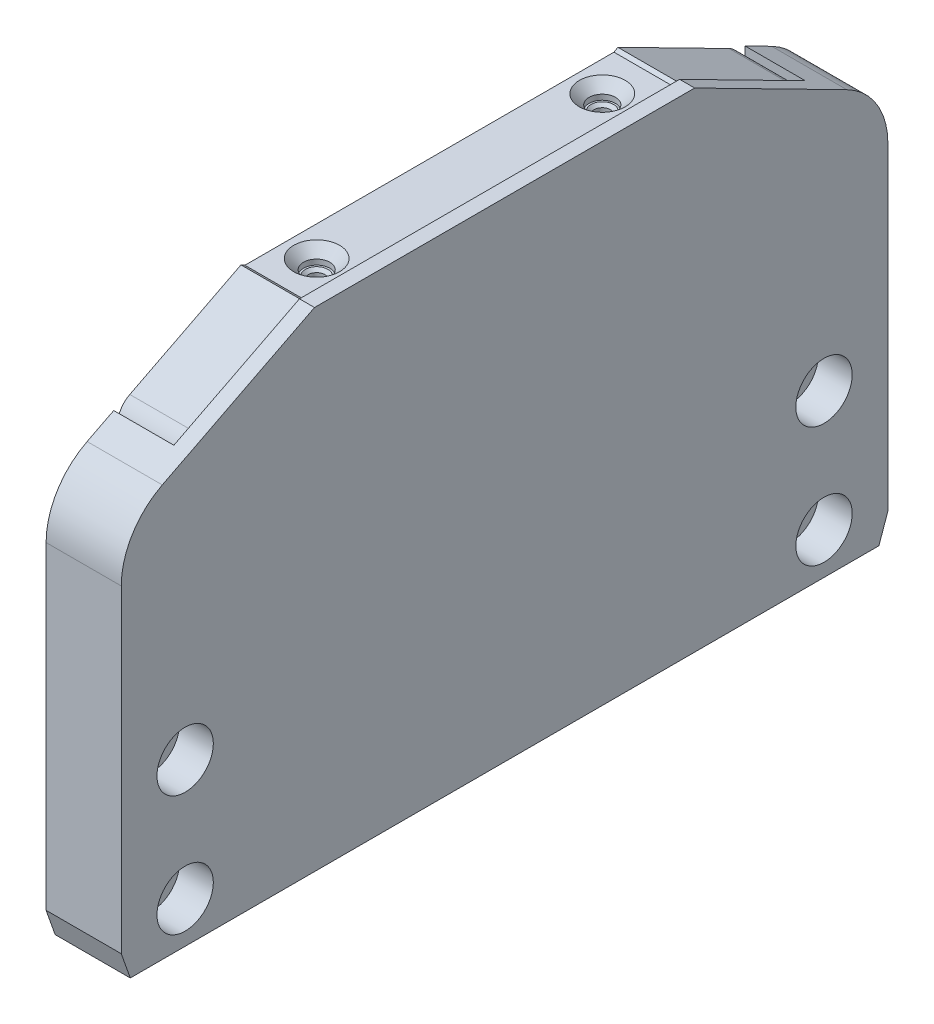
ISO-10303-21;
HEADER;
FILE_DESCRIPTION(('STEP AP214'),'2;1');
FILE_NAME('part.step','',(''),(''),'','','');
FILE_SCHEMA(('AUTOMOTIVE_DESIGN { 1 0 10303 214 1 1 1 1 }'));
ENDSEC;
DATA;
#1=APPLICATION_CONTEXT('core data for automotive mechanical design processes');
#2=APPLICATION_PROTOCOL_DEFINITION('international standard','automotive_design',2000,#1);
#3=PRODUCT_CONTEXT('',#1,'mechanical');
#4=PRODUCT('Part','Part','',(#3));
#5=PRODUCT_RELATED_PRODUCT_CATEGORY('part','',(#4));
#6=PRODUCT_DEFINITION_FORMATION('','',#4);
#7=PRODUCT_DEFINITION_CONTEXT('part definition',#1,'design');
#8=PRODUCT_DEFINITION('design','',#6,#7);
#9=PRODUCT_DEFINITION_SHAPE('','',#8);
#10=(LENGTH_UNIT() NAMED_UNIT(*) SI_UNIT(.MILLI.,.METRE.));
#11=(NAMED_UNIT(*) PLANE_ANGLE_UNIT() SI_UNIT($,.RADIAN.));
#12=(NAMED_UNIT(*) SI_UNIT($,.STERADIAN.) SOLID_ANGLE_UNIT());
#13=UNCERTAINTY_MEASURE_WITH_UNIT(LENGTH_MEASURE(1.E-05),#10,'distance_accuracy_value','');
#14=(GEOMETRIC_REPRESENTATION_CONTEXT(3) GLOBAL_UNCERTAINTY_ASSIGNED_CONTEXT((#13)) GLOBAL_UNIT_ASSIGNED_CONTEXT((#10,
#11,#12)) REPRESENTATION_CONTEXT('',''));
#15=CARTESIAN_POINT('',(0.,0.,0.));
#16=DIRECTION('',(0.,0.,1.));
#17=DIRECTION('',(1.,0.,0.));
#18=AXIS2_PLACEMENT_3D('',#15,#16,#17);
#19=CARTESIAN_POINT('',(199.,63.000000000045,19.));
#20=DIRECTION('',(0.,1.,0.));
#21=DIRECTION('',(0.,0.,1.));
#22=AXIS2_PLACEMENT_3D('',#19,#20,#21);
#23=CONICAL_SURFACE('',#22,1.49999999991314,0.785398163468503);
#24=CARTESIAN_POINT('',(199.,62.5999999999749,19.));
#25=DIRECTION('',(0.,1.,0.));
#26=DIRECTION('',(0.,0.,1.));
#27=AXIS2_PLACEMENT_3D('',#24,#25,#26);
#28=CIRCLE('',#27,1.09999999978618);
#29=CARTESIAN_POINT('',(199.,62.5999999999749,20.0999999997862));
#30=VERTEX_POINT('',#29);
#31=EDGE_CURVE('E367',#30,#30,#28,.T.);
#32=ORIENTED_EDGE('',*,*,#31,.F.);
#33=EDGE_LOOP('',(#32));
#34=FACE_BOUND('',#33,.T.);
#35=CARTESIAN_POINT('',(199.,63.000000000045,19.));
#36=DIRECTION('',(0.,1.,0.));
#37=DIRECTION('',(0.,0.,1.));
#38=AXIS2_PLACEMENT_3D('',#35,#36,#37);
#39=CIRCLE('',#38,1.49999999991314);
#40=CARTESIAN_POINT('',(199.,63.0000000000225,20.4999999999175));
#41=VERTEX_POINT('',#40);
#42=EDGE_CURVE('E30',#41,#41,#39,.T.);
#43=ORIENTED_EDGE('',*,*,#42,.T.);
#44=EDGE_LOOP('',(#43));
#45=FACE_BOUND('',#44,.T.);
#46=ADVANCED_FACE('F16',(#34,#45),#23,.F.);
#47=CARTESIAN_POINT('',(199.,54.848,19.));
#48=DIRECTION('',(0.,1.,0.));
#49=DIRECTION('',(0.,0.,1.));
#50=AXIS2_PLACEMENT_3D('',#47,#48,#49);
#51=CYLINDRICAL_SURFACE('',#50,1.1);
#52=CARTESIAN_POINT('',(199.,55.,19.));
#53=DIRECTION('',(0.,1.,0.));
#54=DIRECTION('',(0.,0.,1.));
#55=AXIS2_PLACEMENT_3D('',#52,#53,#54);
#56=CIRCLE('',#55,1.1);
#57=CARTESIAN_POINT('',(199.,55.,20.1));
#58=VERTEX_POINT('',#57);
#59=EDGE_CURVE('E370',#58,#58,#56,.T.);
#60=ORIENTED_EDGE('',*,*,#59,.F.);
#61=EDGE_LOOP('',(#60));
#62=FACE_BOUND('',#61,.T.);
#63=ORIENTED_EDGE('',*,*,#31,.T.);
#64=EDGE_LOOP('',(#63));
#65=FACE_BOUND('',#64,.T.);
#66=ADVANCED_FACE('F1588',(#62,#65),#51,.F.);
#67=CARTESIAN_POINT('',(199.,55.,19.));
#68=DIRECTION('',(0.,1.,0.));
#69=DIRECTION('',(0.,0.,1.));
#70=AXIS2_PLACEMENT_3D('',#67,#68,#69);
#71=PLANE('',#70);
#72=ORIENTED_EDGE('',*,*,#59,.T.);
#73=EDGE_LOOP('',(#72));
#74=FACE_BOUND('',#73,.T.);
#75=ADVANCED_FACE('F18',(#74),#71,.T.);
#76=CARTESIAN_POINT('',(198.9999749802,63.,18.87499999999));
#77=DIRECTION('',(0.,1.,0.));
#78=DIRECTION('',(0.,0.,1.));
#79=AXIS2_PLACEMENT_3D('',#76,#77,#78);
#80=PLANE('',#79);
#81=DIRECTION('',(-1.,0.,0.));
#82=VECTOR('',#81,1.);
#83=CARTESIAN_POINT('',(203.16,63.,20.4999999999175));
#84=LINE('',#83,#82);
#85=CARTESIAN_POINT('',(199.901387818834,63.,20.4999999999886));
#86=VERTEX_POINT('',#85);
#87=EDGE_CURVE('E73',#86,#41,#84,.T.);
#88=ORIENTED_EDGE('',*,*,#87,.F.);
#89=CARTESIAN_POINT('',(199.,63.,19.));
#90=DIRECTION('',(0.,1.,0.));
#91=DIRECTION('',(0.,0.,1.));
#92=AXIS2_PLACEMENT_3D('',#89,#90,#91);
#93=CIRCLE('',#92,1.75);
#94=CARTESIAN_POINT('',(198.098612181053,63.,20.4999999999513));
#95=VERTEX_POINT('',#94);
#96=EDGE_CURVE('E352',#86,#95,#93,.T.);
#97=ORIENTED_EDGE('',*,*,#96,.T.);
#98=EDGE_CURVE('E575',#41,#95,#84,.T.);
#99=ORIENTED_EDGE('',*,*,#98,.F.);
#100=ORIENTED_EDGE('',*,*,#42,.F.);
#101=EDGE_LOOP('',(#88,#97,#99,#100));
#102=FACE_BOUND('',#101,.T.);
#103=ADVANCED_FACE('F1578',(#102),#80,.T.);
#104=CARTESIAN_POINT('',(199.,63.000000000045,-19.));
#105=DIRECTION('',(0.,1.,0.));
#106=DIRECTION('',(0.,0.,1.));
#107=AXIS2_PLACEMENT_3D('',#104,#105,#106);
#108=CONICAL_SURFACE('',#107,1.49999999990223,0.785398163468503);
#109=CARTESIAN_POINT('',(199.,63.000000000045,-19.));
#110=DIRECTION('',(0.,1.,0.));
#111=DIRECTION('',(0.,0.,1.));
#112=AXIS2_PLACEMENT_3D('',#109,#110,#111);
#113=CIRCLE('',#112,1.49999999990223);
#114=CARTESIAN_POINT('',(199.,63.0000000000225,-20.4999999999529));
#115=VERTEX_POINT('',#114);
#116=EDGE_CURVE('E25',#115,#115,#113,.T.);
#117=ORIENTED_EDGE('',*,*,#116,.T.);
#118=EDGE_LOOP('',(#117));
#119=FACE_BOUND('',#118,.T.);
#120=CARTESIAN_POINT('',(199.,62.5999999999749,-19.));
#121=DIRECTION('',(0.,1.,0.));
#122=DIRECTION('',(0.,0.,1.));
#123=AXIS2_PLACEMENT_3D('',#120,#121,#122);
#124=CIRCLE('',#123,1.09999999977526);
#125=CARTESIAN_POINT('',(199.,62.5999999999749,-17.9000000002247));
#126=VERTEX_POINT('',#125);
#127=EDGE_CURVE('E346',#126,#126,#124,.T.);
#128=ORIENTED_EDGE('',*,*,#127,.F.);
#129=EDGE_LOOP('',(#128));
#130=FACE_BOUND('',#129,.T.);
#131=ADVANCED_FACE('F379',(#119,#130),#108,.F.);
#132=CARTESIAN_POINT('',(199.,54.848,-19.));
#133=DIRECTION('',(0.,1.,0.));
#134=DIRECTION('',(0.,0.,1.));
#135=AXIS2_PLACEMENT_3D('',#132,#133,#134);
#136=CYLINDRICAL_SURFACE('',#135,1.1);
#137=ORIENTED_EDGE('',*,*,#127,.T.);
#138=EDGE_LOOP('',(#137));
#139=FACE_BOUND('',#138,.T.);
#140=CARTESIAN_POINT('',(199.,55.,-19.));
#141=DIRECTION('',(0.,1.,0.));
#142=DIRECTION('',(0.,0.,1.));
#143=AXIS2_PLACEMENT_3D('',#140,#141,#142);
#144=CIRCLE('',#143,1.1);
#145=CARTESIAN_POINT('',(199.,55.,-17.9));
#146=VERTEX_POINT('',#145);
#147=EDGE_CURVE('E341',#146,#146,#144,.T.);
#148=ORIENTED_EDGE('',*,*,#147,.F.);
#149=EDGE_LOOP('',(#148));
#150=FACE_BOUND('',#149,.T.);
#151=ADVANCED_FACE('F1577',(#139,#150),#136,.F.);
#152=CARTESIAN_POINT('',(199.,55.,-19.));
#153=DIRECTION('',(0.,1.,0.));
#154=DIRECTION('',(0.,0.,1.));
#155=AXIS2_PLACEMENT_3D('',#152,#153,#154);
#156=PLANE('',#155);
#157=ORIENTED_EDGE('',*,*,#147,.T.);
#158=EDGE_LOOP('',(#157));
#159=FACE_BOUND('',#158,.T.);
#160=ADVANCED_FACE('F396',(#159),#156,.T.);
#161=CARTESIAN_POINT('',(199.,62.85256960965,-19.));
#162=DIRECTION('',(0.,1.,0.));
#163=DIRECTION('',(0.,0.,1.));
#164=AXIS2_PLACEMENT_3D('',#161,#162,#163);
#165=CYLINDRICAL_SURFACE('',#164,1.75);
#166=CARTESIAN_POINT('',(199.,63.,-19.));
#167=DIRECTION('',(0.,1.,0.));
#168=DIRECTION('',(0.,0.,1.));
#169=AXIS2_PLACEMENT_3D('',#166,#167,#168);
#170=CIRCLE('',#169,1.75);
#171=CARTESIAN_POINT('',(198.098612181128,63.,-20.5));
#172=VERTEX_POINT('',#171);
#173=CARTESIAN_POINT('',(199.901387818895,63.,-20.4999999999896));
#174=VERTEX_POINT('',#173);
#175=EDGE_CURVE('E38',#172,#174,#170,.T.);
#176=ORIENTED_EDGE('',*,*,#175,.F.);
#177=CARTESIAN_POINT('',(199.,63.,-19.));
#178=DIRECTION('',(0.,1.,0.));
#179=DIRECTION('',(0.,0.,1.));
#180=AXIS2_PLACEMENT_3D('',#177,#178,#179);
#181=CIRCLE('',#180,1.75);
#182=EDGE_CURVE('E337',#174,#172,#181,.T.);
#183=ORIENTED_EDGE('',*,*,#182,.F.);
#184=EDGE_LOOP('',(#176,#183));
#185=FACE_BOUND('',#184,.T.);
#186=CARTESIAN_POINT('',(199.,63.699999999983,-19.));
#187=DIRECTION('',(0.,1.,0.));
#188=DIRECTION('',(0.,0.,1.));
#189=AXIS2_PLACEMENT_3D('',#186,#187,#188);
#190=CIRCLE('',#189,1.75000000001);
#191=CARTESIAN_POINT('',(199.,63.699999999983,-17.24999999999));
#192=VERTEX_POINT('',#191);
#193=EDGE_CURVE('E340',#192,#192,#190,.T.);
#194=ORIENTED_EDGE('',*,*,#193,.T.);
#195=EDGE_LOOP('',(#194));
#196=FACE_BOUND('',#195,.T.);
#197=ADVANCED_FACE('F393',(#185,#196),#165,.F.);
#198=CARTESIAN_POINT('',(199.,63.,-21.875));
#199=DIRECTION('',(0.,1.,0.));
#200=DIRECTION('',(0.,0.,1.));
#201=AXIS2_PLACEMENT_3D('',#198,#199,#200);
#202=PLANE('',#201);
#203=DIRECTION('',(-1.,0.,0.));
#204=VECTOR('',#203,1.);
#205=CARTESIAN_POINT('',(203.16,63.,-20.4999999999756));
#206=LINE('',#205,#204);
#207=CARTESIAN_POINT('',(203.,63.,-20.4999999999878));
#208=VERTEX_POINT('',#207);
#209=EDGE_CURVE('E345',#174,#208,#206,.F.);
#210=ORIENTED_EDGE('',*,*,#209,.F.);
#211=ORIENTED_EDGE('',*,*,#182,.T.);
#212=DIRECTION('',(-1.,0.,0.));
#213=VECTOR('',#212,1.);
#214=CARTESIAN_POINT('',(203.16,63.,-20.5));
#215=LINE('',#214,#213);
#216=CARTESIAN_POINT('',(195.,63.,-20.5));
#217=VERTEX_POINT('',#216);
#218=EDGE_CURVE('E342',#217,#172,#215,.F.);
#219=ORIENTED_EDGE('',*,*,#218,.F.);
#220=DIRECTION('',(0.,0.,-1.));
#221=VECTOR('',#220,1.);
#222=CARTESIAN_POINT('',(195.,63.,0.));
#223=LINE('',#222,#221);
#224=CARTESIAN_POINT('',(195.,63.,-23.25));
#225=VERTEX_POINT('',#224);
#226=EDGE_CURVE('E344',#217,#225,#223,.T.);
#227=ORIENTED_EDGE('',*,*,#226,.T.);
#228=DIRECTION('',(1.,0.,0.));
#229=VECTOR('',#228,1.);
#230=CARTESIAN_POINT('',(199.,63.,-23.25));
#231=LINE('',#230,#229);
#232=CARTESIAN_POINT('',(203.,63.,-23.25));
#233=VERTEX_POINT('',#232);
#234=EDGE_CURVE('E406',#233,#225,#231,.F.);
#235=ORIENTED_EDGE('',*,*,#234,.F.);
#236=DIRECTION('',(0.,0.,-1.));
#237=VECTOR('',#236,1.);
#238=CARTESIAN_POINT('',(203.,63.,0.));
#239=LINE('',#238,#237);
#240=EDGE_CURVE('E409',#233,#208,#239,.F.);
#241=ORIENTED_EDGE('',*,*,#240,.T.);
#242=EDGE_LOOP('',(#210,#211,#219,#227,#235,#241));
#243=FACE_BOUND('',#242,.T.);
#244=ADVANCED_FACE('F391',(#243),#202,.F.);
#245=CARTESIAN_POINT('',(203.16,60.,-20.5));
#246=DIRECTION('',(-1.,0.,0.));
#247=DIRECTION('',(0.,0.,1.));
#248=AXIS2_PLACEMENT_3D('',#245,#246,#247);
#249=CYLINDRICAL_SURFACE('',#248,3.);
#250=ORIENTED_EDGE('',*,*,#209,.T.);
#251=CARTESIAN_POINT('',(203.,60.,-20.5));
#252=DIRECTION('',(-1.,0.,0.));
#253=DIRECTION('',(0.,0.,1.));
#254=AXIS2_PLACEMENT_3D('',#251,#252,#253);
#255=CIRCLE('',#254,3.);
#256=CARTESIAN_POINT('',(203.,60.,-23.5));
#257=VERTEX_POINT('',#256);
#258=EDGE_CURVE('E411',#208,#257,#255,.T.);
#259=ORIENTED_EDGE('',*,*,#258,.T.);
#260=DIRECTION('',(1.,0.,0.));
#261=VECTOR('',#260,1.);
#262=CARTESIAN_POINT('',(199.,60.,-23.5));
#263=LINE('',#262,#261);
#264=CARTESIAN_POINT('',(195.,60.,-23.5));
#265=VERTEX_POINT('',#264);
#266=EDGE_CURVE('E414',#257,#265,#263,.F.);
#267=ORIENTED_EDGE('',*,*,#266,.T.);
#268=CARTESIAN_POINT('',(195.,60.,-20.5));
#269=DIRECTION('',(-1.,0.,0.));
#270=DIRECTION('',(0.,0.,1.));
#271=AXIS2_PLACEMENT_3D('',#268,#269,#270);
#272=CIRCLE('',#271,3.);
#273=EDGE_CURVE('E387',#265,#217,#272,.F.);
#274=ORIENTED_EDGE('',*,*,#273,.T.);
#275=ORIENTED_EDGE('',*,*,#218,.T.);
#276=DIRECTION('',(-1.,0.,0.));
#277=VECTOR('',#276,1.);
#278=CARTESIAN_POINT('',(199.000000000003,63.,-20.5000000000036));
#279=LINE('',#278,#277);
#280=EDGE_CURVE('E10',#115,#172,#279,.T.);
#281=ORIENTED_EDGE('',*,*,#280,.F.);
#282=DIRECTION('',(-1.,0.,0.));
#283=VECTOR('',#282,1.);
#284=CARTESIAN_POINT('',(199.000000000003,63.,-20.5000000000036));
#285=LINE('',#284,#283);
#286=EDGE_CURVE('E20',#174,#115,#285,.T.);
#287=ORIENTED_EDGE('',*,*,#286,.F.);
#288=EDGE_LOOP('',(#250,#259,#267,#274,#275,#281,#287));
#289=FACE_BOUND('',#288,.T.);
#290=ADVANCED_FACE('F381',(#289),#249,.T.);
#291=CARTESIAN_POINT('',(199.,64.999999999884,-19.));
#292=DIRECTION('',(0.,1.,0.));
#293=DIRECTION('',(0.,0.,1.));
#294=AXIS2_PLACEMENT_3D('',#291,#292,#293);
#295=CONICAL_SURFACE('',#294,3.04999999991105,0.785398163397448);
#296=ORIENTED_EDGE('',*,*,#193,.F.);
#297=EDGE_LOOP('',(#296));
#298=FACE_BOUND('',#297,.T.);
#299=CARTESIAN_POINT('',(199.,64.9999999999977,-19.));
#300=DIRECTION('',(0.,1.,0.));
#301=DIRECTION('',(0.,0.,1.));
#302=AXIS2_PLACEMENT_3D('',#299,#300,#301);
#303=CIRCLE('',#302,3.05000000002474);
#304=CARTESIAN_POINT('',(199.,64.9999999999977,-15.9499999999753));
#305=VERTEX_POINT('',#304);
#306=EDGE_CURVE('E417',#305,#305,#303,.F.);
#307=ORIENTED_EDGE('',*,*,#306,.F.);
#308=EDGE_LOOP('',(#307));
#309=FACE_BOUND('',#308,.T.);
#310=ADVANCED_FACE('F1240',(#298,#309),#295,.F.);
#311=CARTESIAN_POINT('',(203.,58.5,0.));
#312=DIRECTION('',(1.,0.,0.));
#313=DIRECTION('',(0.,0.,-1.));
#314=AXIS2_PLACEMENT_3D('',#311,#312,#313);
#315=PLANE('',#314);
#316=CARTESIAN_POINT('',(203.,61.13015933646,27.75));
#317=DIRECTION('',(1.,0.,0.));
#318=DIRECTION('',(0.,0.,-1.));
#319=AXIS2_PLACEMENT_3D('',#316,#317,#318);
#320=CIRCLE('',#319,1.);
#321=CARTESIAN_POINT('',(203.,61.13015933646,26.75));
#322=VERTEX_POINT('',#321);
#323=CARTESIAN_POINT('',(203.,62.0211658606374,28.2039904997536));
#324=VERTEX_POINT('',#323);
#325=EDGE_CURVE('E82',#322,#324,#320,.T.);
#326=ORIENTED_EDGE('',*,*,#325,.F.);
#327=DIRECTION('',(0.,1.,0.));
#328=VECTOR('',#327,1.);
#329=CARTESIAN_POINT('',(203.,58.5,26.75));
#330=LINE('',#329,#328);
#331=CARTESIAN_POINT('',(203.,54.9,26.75));
#332=VERTEX_POINT('',#331);
#333=EDGE_CURVE('E421',#332,#322,#330,.T.);
#334=ORIENTED_EDGE('',*,*,#333,.F.);
#335=CARTESIAN_POINT('',(203.,54.9,26.35));
#336=DIRECTION('',(1.,0.,0.));
#337=DIRECTION('',(0.,0.,-1.));
#338=AXIS2_PLACEMENT_3D('',#335,#336,#337);
#339=CIRCLE('',#338,0.400000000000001);
#340=CARTESIAN_POINT('',(203.,54.5,26.35));
#341=VERTEX_POINT('',#340);
#342=EDGE_CURVE('E424',#341,#332,#339,.F.);
#343=ORIENTED_EDGE('',*,*,#342,.F.);
#344=DIRECTION('',(0.,0.,1.));
#345=VECTOR('',#344,1.);
#346=CARTESIAN_POINT('',(203.,54.5,25.5));
#347=LINE('',#346,#345);
#348=CARTESIAN_POINT('',(203.,54.5,24.65));
#349=VERTEX_POINT('',#348);
#350=EDGE_CURVE('E427',#341,#349,#347,.F.);
#351=ORIENTED_EDGE('',*,*,#350,.T.);
#352=CARTESIAN_POINT('',(203.,54.9,24.65));
#353=DIRECTION('',(-1.,0.,0.));
#354=DIRECTION('',(0.,0.,1.));
#355=AXIS2_PLACEMENT_3D('',#352,#353,#354);
#356=CIRCLE('',#355,0.400000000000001);
#357=CARTESIAN_POINT('',(203.,54.9,24.25));
#358=VERTEX_POINT('',#357);
#359=EDGE_CURVE('E430',#358,#349,#356,.T.);
#360=ORIENTED_EDGE('',*,*,#359,.F.);
#361=DIRECTION('',(0.,1.,0.));
#362=VECTOR('',#361,1.);
#363=CARTESIAN_POINT('',(203.,58.5,24.25));
#364=LINE('',#363,#362);
#365=CARTESIAN_POINT('',(203.,62.,24.25));
#366=VERTEX_POINT('',#365);
#367=EDGE_CURVE('E433',#366,#358,#364,.F.);
#368=ORIENTED_EDGE('',*,*,#367,.F.);
#369=CARTESIAN_POINT('',(203.,62.,23.25));
#370=DIRECTION('',(1.,0.,0.));
#371=DIRECTION('',(0.,0.,-1.));
#372=AXIS2_PLACEMENT_3D('',#369,#370,#371);
#373=CIRCLE('',#372,1.);
#374=CARTESIAN_POINT('',(203.,63.,23.25));
#375=VERTEX_POINT('',#374);
#376=EDGE_CURVE('E436',#366,#375,#373,.F.);
#377=ORIENTED_EDGE('',*,*,#376,.T.);
#378=DIRECTION('',(0.,0.,-1.));
#379=VECTOR('',#378,1.);
#380=CARTESIAN_POINT('',(203.,63.,0.));
#381=LINE('',#380,#379);
#382=CARTESIAN_POINT('',(203.,63.,20.5));
#383=VERTEX_POINT('',#382);
#384=EDGE_CURVE('E439',#383,#375,#381,.F.);
#385=ORIENTED_EDGE('',*,*,#384,.F.);
#386=CARTESIAN_POINT('',(203.,60.,20.5));
#387=DIRECTION('',(-1.,0.,0.));
#388=DIRECTION('',(0.,0.,1.));
#389=AXIS2_PLACEMENT_3D('',#386,#387,#388);
#390=CIRCLE('',#389,3.);
#391=CARTESIAN_POINT('',(203.,60.,23.5));
#392=VERTEX_POINT('',#391);
#393=EDGE_CURVE('E442',#392,#383,#390,.T.);
#394=ORIENTED_EDGE('',*,*,#393,.F.);
#395=DIRECTION('',(0.,1.,0.));
#396=VECTOR('',#395,1.);
#397=CARTESIAN_POINT('',(203.,58.5,23.5));
#398=LINE('',#397,#396);
#399=CARTESIAN_POINT('',(203.,54.5,23.5));
#400=VERTEX_POINT('',#399);
#401=EDGE_CURVE('E445',#400,#392,#398,.T.);
#402=ORIENTED_EDGE('',*,*,#401,.F.);
#403=CARTESIAN_POINT('',(203.,54.5,26.5));
#404=DIRECTION('',(1.,0.,0.));
#405=DIRECTION('',(0.,0.,-1.));
#406=AXIS2_PLACEMENT_3D('',#403,#404,#405);
#407=CIRCLE('',#406,3.);
#408=CARTESIAN_POINT('',(203.,51.5,26.5));
#409=VERTEX_POINT('',#408);
#410=EDGE_CURVE('E448',#409,#400,#407,.T.);
#411=ORIENTED_EDGE('',*,*,#410,.F.);
#412=DIRECTION('',(0.,0.,-1.));
#413=VECTOR('',#412,1.);
#414=CARTESIAN_POINT('',(203.,51.5,0.));
#415=LINE('',#414,#413);
#416=CARTESIAN_POINT('',(203.,51.5,39.));
#417=VERTEX_POINT('',#416);
#418=EDGE_CURVE('E451',#417,#409,#415,.T.);
#419=ORIENTED_EDGE('',*,*,#418,.F.);
#420=CARTESIAN_POINT('',(203.,54.5,39.));
#421=DIRECTION('',(1.,0.,0.));
#422=DIRECTION('',(0.,0.,-1.));
#423=AXIS2_PLACEMENT_3D('',#420,#421,#422);
#424=CIRCLE('',#423,3.);
#425=CARTESIAN_POINT('',(203.,54.5,41.9999999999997));
#426=VERTEX_POINT('',#425);
#427=EDGE_CURVE('E454',#426,#417,#424,.T.);
#428=ORIENTED_EDGE('',*,*,#427,.F.);
#429=DIRECTION('',(0.,1.,0.));
#430=VECTOR('',#429,1.);
#431=CARTESIAN_POINT('',(203.,58.5,41.9999999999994));
#432=LINE('',#431,#430);
#433=CARTESIAN_POINT('',(203.,56.9857290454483,41.9999999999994));
#434=VERTEX_POINT('',#433);
#435=EDGE_CURVE('E457',#434,#426,#432,.F.);
#436=ORIENTED_EDGE('',*,*,#435,.F.);
#437=DIRECTION('',(0.,-0.453990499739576,0.891006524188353));
#438=VECTOR('',#437,1.);
#439=CARTESIAN_POINT('',(203.,60.34102868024,35.41485368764));
#440=LINE('',#439,#438);
#441=CARTESIAN_POINT('',(203.,65.5,25.28980237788));
#442=VERTEX_POINT('',#441);
#443=EDGE_CURVE('E460',#442,#434,#440,.T.);
#444=ORIENTED_EDGE('',*,*,#443,.F.);
#445=DIRECTION('',(0.,0.,1.));
#446=VECTOR('',#445,1.);
#447=CARTESIAN_POINT('',(203.,65.5,0.));
#448=LINE('',#447,#446);
#449=CARTESIAN_POINT('',(203.,65.5,-25.28980237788));
#450=VERTEX_POINT('',#449);
#451=EDGE_CURVE('E463',#450,#442,#448,.T.);
#452=ORIENTED_EDGE('',*,*,#451,.F.);
#453=DIRECTION('',(0.,0.453990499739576,0.891006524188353));
#454=VECTOR('',#453,1.);
#455=CARTESIAN_POINT('',(203.,60.34102868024,-35.41485368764));
#456=LINE('',#455,#454);
#457=CARTESIAN_POINT('',(203.,56.9857290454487,-41.9999999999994));
#458=VERTEX_POINT('',#457);
#459=EDGE_CURVE('E466',#458,#450,#456,.T.);
#460=ORIENTED_EDGE('',*,*,#459,.F.);
#461=DIRECTION('',(0.,1.,0.));
#462=VECTOR('',#461,1.);
#463=CARTESIAN_POINT('',(203.,58.5,-42.));
#464=LINE('',#463,#462);
#465=CARTESIAN_POINT('',(203.,54.5,-42.));
#466=VERTEX_POINT('',#465);
#467=EDGE_CURVE('E469',#466,#458,#464,.T.);
#468=ORIENTED_EDGE('',*,*,#467,.F.);
#469=CARTESIAN_POINT('',(203.,54.5,-39.));
#470=DIRECTION('',(1.,0.,0.));
#471=DIRECTION('',(0.,0.,-1.));
#472=AXIS2_PLACEMENT_3D('',#469,#470,#471);
#473=CIRCLE('',#472,3.);
#474=CARTESIAN_POINT('',(203.,51.5,-39.));
#475=VERTEX_POINT('',#474);
#476=EDGE_CURVE('E472',#475,#466,#473,.T.);
#477=ORIENTED_EDGE('',*,*,#476,.F.);
#478=DIRECTION('',(0.,0.,-1.));
#479=VECTOR('',#478,1.);
#480=CARTESIAN_POINT('',(203.,51.5,0.));
#481=LINE('',#480,#479);
#482=CARTESIAN_POINT('',(203.,51.5,-26.5));
#483=VERTEX_POINT('',#482);
#484=EDGE_CURVE('E475',#483,#475,#481,.T.);
#485=ORIENTED_EDGE('',*,*,#484,.F.);
#486=CARTESIAN_POINT('',(203.,54.5,-26.5));
#487=DIRECTION('',(1.,0.,0.));
#488=DIRECTION('',(0.,0.,-1.));
#489=AXIS2_PLACEMENT_3D('',#486,#487,#488);
#490=CIRCLE('',#489,3.);
#491=CARTESIAN_POINT('',(203.,54.5,-23.5));
#492=VERTEX_POINT('',#491);
#493=EDGE_CURVE('E478',#492,#483,#490,.T.);
#494=ORIENTED_EDGE('',*,*,#493,.F.);
#495=DIRECTION('',(0.,1.,0.));
#496=VECTOR('',#495,1.);
#497=CARTESIAN_POINT('',(203.,58.5,-23.5));
#498=LINE('',#497,#496);
#499=EDGE_CURVE('E481',#257,#492,#498,.F.);
#500=ORIENTED_EDGE('',*,*,#499,.F.);
#501=ORIENTED_EDGE('',*,*,#258,.F.);
#502=ORIENTED_EDGE('',*,*,#240,.F.);
#503=CARTESIAN_POINT('',(203.,62.,-23.25));
#504=DIRECTION('',(1.,0.,0.));
#505=DIRECTION('',(0.,0.,-1.));
#506=AXIS2_PLACEMENT_3D('',#503,#504,#505);
#507=CIRCLE('',#506,1.);
#508=CARTESIAN_POINT('',(203.,62.,-24.25));
#509=VERTEX_POINT('',#508);
#510=EDGE_CURVE('E484',#233,#509,#507,.F.);
#511=ORIENTED_EDGE('',*,*,#510,.T.);
#512=DIRECTION('',(0.,1.,0.));
#513=VECTOR('',#512,1.);
#514=CARTESIAN_POINT('',(203.,58.5,-24.25));
#515=LINE('',#514,#513);
#516=CARTESIAN_POINT('',(203.,54.9,-24.25));
#517=VERTEX_POINT('',#516);
#518=EDGE_CURVE('E487',#517,#509,#515,.T.);
#519=ORIENTED_EDGE('',*,*,#518,.F.);
#520=CARTESIAN_POINT('',(203.,54.9,-24.65));
#521=DIRECTION('',(1.,0.,0.));
#522=DIRECTION('',(0.,0.,-1.));
#523=AXIS2_PLACEMENT_3D('',#520,#521,#522);
#524=CIRCLE('',#523,0.400000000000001);
#525=CARTESIAN_POINT('',(203.,54.5,-24.65));
#526=VERTEX_POINT('',#525);
#527=EDGE_CURVE('E490',#526,#517,#524,.F.);
#528=ORIENTED_EDGE('',*,*,#527,.F.);
#529=DIRECTION('',(0.,0.,1.));
#530=VECTOR('',#529,1.);
#531=CARTESIAN_POINT('',(203.,54.5,-25.5));
#532=LINE('',#531,#530);
#533=CARTESIAN_POINT('',(203.,54.5,-26.35));
#534=VERTEX_POINT('',#533);
#535=EDGE_CURVE('E493',#526,#534,#532,.F.);
#536=ORIENTED_EDGE('',*,*,#535,.T.);
#537=CARTESIAN_POINT('',(203.,54.9,-26.35));
#538=DIRECTION('',(-1.,0.,0.));
#539=DIRECTION('',(0.,0.,1.));
#540=AXIS2_PLACEMENT_3D('',#537,#538,#539);
#541=CIRCLE('',#540,0.400000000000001);
#542=CARTESIAN_POINT('',(203.,54.9,-26.75));
#543=VERTEX_POINT('',#542);
#544=EDGE_CURVE('E496',#543,#534,#541,.T.);
#545=ORIENTED_EDGE('',*,*,#544,.F.);
#546=DIRECTION('',(0.,1.,0.));
#547=VECTOR('',#546,1.);
#548=CARTESIAN_POINT('',(203.,58.5,-26.75));
#549=LINE('',#548,#547);
#550=CARTESIAN_POINT('',(203.,61.1301593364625,-26.75));
#551=VERTEX_POINT('',#550);
#552=EDGE_CURVE('E499',#551,#543,#549,.F.);
#553=ORIENTED_EDGE('',*,*,#552,.F.);
#554=CARTESIAN_POINT('',(203.,61.13015933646,-27.75));
#555=DIRECTION('',(1.,0.,0.));
#556=DIRECTION('',(0.,0.,-1.));
#557=AXIS2_PLACEMENT_3D('',#554,#555,#556);
#558=CIRCLE('',#557,1.000000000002);
#559=CARTESIAN_POINT('',(203.,62.0211658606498,-28.2039904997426));
#560=VERTEX_POINT('',#559);
#561=EDGE_CURVE('E502',#560,#551,#558,.T.);
#562=ORIENTED_EDGE('',*,*,#561,.F.);
#563=DIRECTION('',(0.,0.453990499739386,0.89100652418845));
#564=VECTOR('',#563,1.);
#565=CARTESIAN_POINT('',(203.,56.9610758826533,-38.1349762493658));
#566=LINE('',#565,#564);
#567=CARTESIAN_POINT('',(203.,56.9610758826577,-38.1349762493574));
#568=VERTEX_POINT('',#567);
#569=EDGE_CURVE('E505',#568,#560,#566,.T.);
#570=ORIENTED_EDGE('',*,*,#569,.F.);
#571=CARTESIAN_POINT('',(203.,54.73355957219,-37.));
#572=DIRECTION('',(1.,0.,0.));
#573=DIRECTION('',(0.,0.,-1.));
#574=AXIS2_PLACEMENT_3D('',#571,#572,#573);
#575=CIRCLE('',#574,2.5);
#576=CARTESIAN_POINT('',(203.,54.73355957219,-39.5));
#577=VERTEX_POINT('',#576);
#578=EDGE_CURVE('E508',#577,#568,#575,.T.);
#579=ORIENTED_EDGE('',*,*,#578,.F.);
#580=DIRECTION('',(0.,1.,0.));
#581=VECTOR('',#580,1.);
#582=CARTESIAN_POINT('',(203.,54.56677978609,-39.5));
#583=LINE('',#582,#581);
#584=CARTESIAN_POINT('',(203.,54.4,-39.5));
#585=VERTEX_POINT('',#584);
#586=EDGE_CURVE('E511',#585,#577,#583,.T.);
#587=ORIENTED_EDGE('',*,*,#586,.F.);
#588=CARTESIAN_POINT('',(203.,54.4,-39.9));
#589=DIRECTION('',(-1.,0.,0.));
#590=DIRECTION('',(0.,0.,1.));
#591=AXIS2_PLACEMENT_3D('',#588,#589,#590);
#592=CIRCLE('',#591,0.399999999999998);
#593=CARTESIAN_POINT('',(203.,54.,-39.9));
#594=VERTEX_POINT('',#593);
#595=EDGE_CURVE('E514',#594,#585,#592,.T.);
#596=ORIENTED_EDGE('',*,*,#595,.F.);
#597=DIRECTION('',(0.,0.,1.));
#598=VECTOR('',#597,1.);
#599=CARTESIAN_POINT('',(203.,54.,0.));
#600=LINE('',#599,#598);
#601=CARTESIAN_POINT('',(203.,54.,-41.1));
#602=VERTEX_POINT('',#601);
#603=EDGE_CURVE('E517',#594,#602,#600,.F.);
#604=ORIENTED_EDGE('',*,*,#603,.T.);
#605=CARTESIAN_POINT('',(203.,54.4,-41.1));
#606=DIRECTION('',(1.,0.,0.));
#607=DIRECTION('',(0.,0.,-1.));
#608=AXIS2_PLACEMENT_3D('',#605,#606,#607);
#609=CIRCLE('',#608,0.399999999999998);
#610=CARTESIAN_POINT('',(203.,54.4,-41.5));
#611=VERTEX_POINT('',#610);
#612=EDGE_CURVE('E520',#611,#602,#609,.F.);
#613=ORIENTED_EDGE('',*,*,#612,.F.);
#614=DIRECTION('',(0.,1.,0.));
#615=VECTOR('',#614,1.);
#616=CARTESIAN_POINT('',(203.,54.74579881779,-41.5));
#617=LINE('',#616,#615);
#618=CARTESIAN_POINT('',(203.,55.09159763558,-41.5));
#619=VERTEX_POINT('',#618);
#620=EDGE_CURVE('E523',#611,#619,#617,.T.);
#621=ORIENTED_EDGE('',*,*,#620,.T.);
#622=CARTESIAN_POINT('',(203.,55.09159763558,-38.5));
#623=DIRECTION('',(1.,0.,0.));
#624=DIRECTION('',(0.,0.,-1.));
#625=AXIS2_PLACEMENT_3D('',#622,#623,#624);
#626=CIRCLE('',#625,3.);
#627=CARTESIAN_POINT('',(203.,57.7646172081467,-39.8619714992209));
#628=VERTEX_POINT('',#627);
#629=EDGE_CURVE('E526',#628,#619,#626,.F.);
#630=ORIENTED_EDGE('',*,*,#629,.F.);
#631=DIRECTION('',(0.,-0.453990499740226,-0.891006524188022));
#632=VECTOR('',#631,1.);
#633=CARTESIAN_POINT('',(203.,65.3000000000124,-25.0729500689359));
#634=LINE('',#633,#632);
#635=CARTESIAN_POINT('',(203.,65.3000000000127,-25.0729500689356));
#636=VERTEX_POINT('',#635);
#637=EDGE_CURVE('E529',#636,#628,#634,.T.);
#638=ORIENTED_EDGE('',*,*,#637,.F.);
#639=DIRECTION('',(0.,-0.499999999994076,0.866025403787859));
#640=VECTOR('',#639,1.);
#641=CARTESIAN_POINT('',(203.,65.15000000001,-24.81314244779));
#642=LINE('',#641,#640);
#643=CARTESIAN_POINT('',(203.,65.0000000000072,-24.5533348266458));
#644=VERTEX_POINT('',#643);
#645=EDGE_CURVE('E532',#644,#636,#642,.F.);
#646=ORIENTED_EDGE('',*,*,#645,.F.);
#647=DIRECTION('',(0.,0.,-1.));
#648=VECTOR('',#647,1.);
#649=CARTESIAN_POINT('',(203.,65.,0.));
#650=LINE('',#649,#648);
#651=CARTESIAN_POINT('',(203.,65.0000000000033,24.5533348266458));
#652=VERTEX_POINT('',#651);
#653=EDGE_CURVE('E535',#652,#644,#650,.T.);
#654=ORIENTED_EDGE('',*,*,#653,.F.);
#655=DIRECTION('',(0.,0.499999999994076,0.866025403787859));
#656=VECTOR('',#655,1.);
#657=CARTESIAN_POINT('',(203.,65.15000000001,24.81314244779));
#658=LINE('',#657,#656);
#659=CARTESIAN_POINT('',(203.,65.3000000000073,25.0729500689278));
#660=VERTEX_POINT('',#659);
#661=EDGE_CURVE('E538',#660,#652,#658,.F.);
#662=ORIENTED_EDGE('',*,*,#661,.F.);
#663=DIRECTION('',(0.,0.453990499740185,-0.891006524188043));
#664=VECTOR('',#663,1.);
#665=CARTESIAN_POINT('',(203.,57.7646172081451,39.8619714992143));
#666=LINE('',#665,#664);
#667=CARTESIAN_POINT('',(203.,57.7646172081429,39.8619714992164));
#668=VERTEX_POINT('',#667);
#669=EDGE_CURVE('E541',#668,#660,#666,.T.);
#670=ORIENTED_EDGE('',*,*,#669,.F.);
#671=CARTESIAN_POINT('',(203.,55.09159763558,38.5));
#672=DIRECTION('',(-1.,0.,0.));
#673=DIRECTION('',(0.,0.,1.));
#674=AXIS2_PLACEMENT_3D('',#671,#672,#673);
#675=CIRCLE('',#674,3.);
#676=CARTESIAN_POINT('',(203.,55.09159763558,41.5));
#677=VERTEX_POINT('',#676);
#678=EDGE_CURVE('E544',#677,#668,#675,.T.);
#679=ORIENTED_EDGE('',*,*,#678,.F.);
#680=DIRECTION('',(0.,1.,0.));
#681=VECTOR('',#680,1.);
#682=CARTESIAN_POINT('',(203.,54.74579881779,41.5));
#683=LINE('',#682,#681);
#684=CARTESIAN_POINT('',(203.,54.4,41.5));
#685=VERTEX_POINT('',#684);
#686=EDGE_CURVE('E547',#685,#677,#683,.T.);
#687=ORIENTED_EDGE('',*,*,#686,.F.);
#688=CARTESIAN_POINT('',(203.,54.4,41.1));
#689=DIRECTION('',(1.,0.,0.));
#690=DIRECTION('',(0.,0.,-1.));
#691=AXIS2_PLACEMENT_3D('',#688,#689,#690);
#692=CIRCLE('',#691,0.399999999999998);
#693=CARTESIAN_POINT('',(203.,54.,41.1));
#694=VERTEX_POINT('',#693);
#695=EDGE_CURVE('E550',#694,#685,#692,.F.);
#696=ORIENTED_EDGE('',*,*,#695,.F.);
#697=DIRECTION('',(0.,0.,1.));
#698=VECTOR('',#697,1.);
#699=CARTESIAN_POINT('',(203.,54.,0.));
#700=LINE('',#699,#698);
#701=CARTESIAN_POINT('',(203.,54.,39.9));
#702=VERTEX_POINT('',#701);
#703=EDGE_CURVE('E553',#694,#702,#700,.F.);
#704=ORIENTED_EDGE('',*,*,#703,.T.);
#705=CARTESIAN_POINT('',(203.,54.4,39.9));
#706=DIRECTION('',(1.,0.,0.));
#707=DIRECTION('',(0.,0.,-1.));
#708=AXIS2_PLACEMENT_3D('',#705,#706,#707);
#709=CIRCLE('',#708,0.399999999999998);
#710=CARTESIAN_POINT('',(203.,54.4,39.5));
#711=VERTEX_POINT('',#710);
#712=EDGE_CURVE('E556',#711,#702,#709,.F.);
#713=ORIENTED_EDGE('',*,*,#712,.F.);
#714=DIRECTION('',(0.,1.,0.));
#715=VECTOR('',#714,1.);
#716=CARTESIAN_POINT('',(203.,54.56677978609,39.5));
#717=LINE('',#716,#715);
#718=CARTESIAN_POINT('',(203.,54.73355957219,39.5));
#719=VERTEX_POINT('',#718);
#720=EDGE_CURVE('E559',#711,#719,#717,.T.);
#721=ORIENTED_EDGE('',*,*,#720,.T.);
#722=CARTESIAN_POINT('',(203.,54.73355957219,37.));
#723=DIRECTION('',(1.,0.,0.));
#724=DIRECTION('',(0.,0.,-1.));
#725=AXIS2_PLACEMENT_3D('',#722,#723,#724);
#726=CIRCLE('',#725,2.5);
#727=CARTESIAN_POINT('',(203.,56.9610758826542,38.134976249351));
#728=VERTEX_POINT('',#727);
#729=EDGE_CURVE('E562',#728,#719,#726,.T.);
#730=ORIENTED_EDGE('',*,*,#729,.F.);
#731=DIRECTION('',(0.,-0.453990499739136,0.891006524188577));
#732=VECTOR('',#731,1.);
#733=CARTESIAN_POINT('',(203.,62.0211658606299,28.2039904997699));
#734=LINE('',#733,#732);
#735=EDGE_CURVE('E565',#324,#728,#734,.T.);
#736=ORIENTED_EDGE('',*,*,#735,.F.);
#737=EDGE_LOOP('',(#326,#334,#343,#351,#360,#368,#377,#385,#394,#402,#411,#419,#428,#436,#444,
#452,#460,#468,#477,#485,#494,#500,#501,#502,#511,#519,#528,#536,#545,#553,#562,#570,#579,#587,
#596,#604,#613,#621,#630,#638,#646,#654,#662,#670,#679,#687,#696,#704,#713,#721,#730,#736));
#738=FACE_BOUND('',#737,.T.);
#739=ADVANCED_FACE('F1029',(#738),#315,.F.);
#740=CARTESIAN_POINT('',(199.,62.85256960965,19.));
#741=DIRECTION('',(0.,1.,0.));
#742=DIRECTION('',(0.,0.,1.));
#743=AXIS2_PLACEMENT_3D('',#740,#741,#742);
#744=CYLINDRICAL_SURFACE('',#743,1.75);
#745=CARTESIAN_POINT('',(199.,63.6999999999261,19.));
#746=DIRECTION('',(0.,1.,0.));
#747=DIRECTION('',(0.,0.,1.));
#748=AXIS2_PLACEMENT_3D('',#745,#746,#747);
#749=CIRCLE('',#748,1.74999999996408);
#750=CARTESIAN_POINT('',(199.,63.6999999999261,20.7499999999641));
#751=VERTEX_POINT('',#750);
#752=EDGE_CURVE('E355',#751,#751,#749,.T.);
#753=ORIENTED_EDGE('',*,*,#752,.T.);
#754=EDGE_LOOP('',(#753));
#755=FACE_BOUND('',#754,.T.);
#756=ORIENTED_EDGE('',*,*,#96,.F.);
#757=CARTESIAN_POINT('',(199.,63.,19.));
#758=DIRECTION('',(0.,1.,0.));
#759=DIRECTION('',(0.,0.,1.));
#760=AXIS2_PLACEMENT_3D('',#757,#758,#759);
#761=CIRCLE('',#760,1.75);
#762=EDGE_CURVE('E354',#95,#86,#761,.T.);
#763=ORIENTED_EDGE('',*,*,#762,.F.);
#764=EDGE_LOOP('',(#756,#763));
#765=FACE_BOUND('',#764,.T.);
#766=ADVANCED_FACE('F1245',(#755,#765),#744,.F.);
#767=CARTESIAN_POINT('',(199.,64.999999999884,19.));
#768=DIRECTION('',(0.,1.,0.));
#769=DIRECTION('',(0.,0.,1.));
#770=AXIS2_PLACEMENT_3D('',#767,#768,#769);
#771=CONICAL_SURFACE('',#770,3.04999999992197,0.785398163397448);
#772=ORIENTED_EDGE('',*,*,#752,.F.);
#773=EDGE_LOOP('',(#772));
#774=FACE_BOUND('',#773,.T.);
#775=CARTESIAN_POINT('',(199.,64.9999999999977,19.));
#776=DIRECTION('',(0.,1.,0.));
#777=DIRECTION('',(0.,0.,1.));
#778=AXIS2_PLACEMENT_3D('',#775,#776,#777);
#779=CIRCLE('',#778,3.05000000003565);
#780=CARTESIAN_POINT('',(199.,64.9999999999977,22.0500000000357));
#781=VERTEX_POINT('',#780);
#782=EDGE_CURVE('E358',#781,#781,#779,.F.);
#783=ORIENTED_EDGE('',*,*,#782,.F.);
#784=EDGE_LOOP('',(#783));
#785=FACE_BOUND('',#784,.T.);
#786=ADVANCED_FACE('F1248',(#774,#785),#771,.F.);
#787=CARTESIAN_POINT('',(199.,63.,21.875));
#788=DIRECTION('',(0.,1.,0.));
#789=DIRECTION('',(0.,0.,1.));
#790=AXIS2_PLACEMENT_3D('',#787,#788,#789);
#791=PLANE('',#790);
#792=ORIENTED_EDGE('',*,*,#762,.T.);
#793=DIRECTION('',(1.,0.,0.));
#794=VECTOR('',#793,1.);
#795=CARTESIAN_POINT('',(199.,63.,20.5));
#796=LINE('',#795,#794);
#797=EDGE_CURVE('E359',#383,#86,#796,.F.);
#798=ORIENTED_EDGE('',*,*,#797,.F.);
#799=ORIENTED_EDGE('',*,*,#384,.T.);
#800=DIRECTION('',(1.,0.,0.));
#801=VECTOR('',#800,1.);
#802=CARTESIAN_POINT('',(199.,63.,23.25));
#803=LINE('',#802,#801);
#804=CARTESIAN_POINT('',(195.,63.,23.25));
#805=VERTEX_POINT('',#804);
#806=EDGE_CURVE('E362',#805,#375,#803,.T.);
#807=ORIENTED_EDGE('',*,*,#806,.F.);
#808=DIRECTION('',(0.,0.,-1.));
#809=VECTOR('',#808,1.);
#810=CARTESIAN_POINT('',(195.,63.,0.));
#811=LINE('',#810,#809);
#812=CARTESIAN_POINT('',(195.,63.,20.4999999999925));
#813=VERTEX_POINT('',#812);
#814=EDGE_CURVE('E366',#805,#813,#811,.T.);
#815=ORIENTED_EDGE('',*,*,#814,.T.);
#816=DIRECTION('',(1.,0.,0.));
#817=VECTOR('',#816,1.);
#818=CARTESIAN_POINT('',(199.,63.,20.499999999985));
#819=LINE('',#818,#817);
#820=EDGE_CURVE('E363',#95,#813,#819,.F.);
#821=ORIENTED_EDGE('',*,*,#820,.F.);
#822=EDGE_LOOP('',(#792,#798,#799,#807,#815,#821));
#823=FACE_BOUND('',#822,.T.);
#824=ADVANCED_FACE('F1252',(#823),#791,.F.);
#825=CARTESIAN_POINT('',(203.16,60.,20.5));
#826=DIRECTION('',(-1.,0.,0.));
#827=DIRECTION('',(0.,0.,1.));
#828=AXIS2_PLACEMENT_3D('',#825,#826,#827);
#829=CYLINDRICAL_SURFACE('',#828,3.);
#830=ORIENTED_EDGE('',*,*,#797,.T.);
#831=ORIENTED_EDGE('',*,*,#87,.T.);
#832=ORIENTED_EDGE('',*,*,#98,.T.);
#833=ORIENTED_EDGE('',*,*,#820,.T.);
#834=CARTESIAN_POINT('',(195.,60.,20.5));
#835=DIRECTION('',(-1.,0.,0.));
#836=DIRECTION('',(0.,0.,1.));
#837=AXIS2_PLACEMENT_3D('',#834,#835,#836);
#838=CIRCLE('',#837,3.);
#839=CARTESIAN_POINT('',(195.,60.,23.5));
#840=VERTEX_POINT('',#839);
#841=EDGE_CURVE('E578',#813,#840,#838,.F.);
#842=ORIENTED_EDGE('',*,*,#841,.T.);
#843=DIRECTION('',(-1.,0.,0.));
#844=VECTOR('',#843,1.);
#845=CARTESIAN_POINT('',(203.16,60.,23.5));
#846=LINE('',#845,#844);
#847=EDGE_CURVE('E580',#840,#392,#846,.F.);
#848=ORIENTED_EDGE('',*,*,#847,.T.);
#849=ORIENTED_EDGE('',*,*,#393,.T.);
#850=EDGE_LOOP('',(#830,#831,#832,#833,#842,#848,#849));
#851=FACE_BOUND('',#850,.T.);
#852=ADVANCED_FACE('F1256',(#851),#829,.T.);
#853=CARTESIAN_POINT('',(199.,57.25,-23.5));
#854=DIRECTION('',(0.,0.,1.));
#855=DIRECTION('',(1.,0.,0.));
#856=AXIS2_PLACEMENT_3D('',#853,#854,#855);
#857=PLANE('',#856);
#858=DIRECTION('',(1.,0.,0.));
#859=VECTOR('',#858,1.);
#860=CARTESIAN_POINT('',(194.84,54.5,-23.5));
#861=LINE('',#860,#859);
#862=CARTESIAN_POINT('',(195.,54.5,-23.5));
#863=VERTEX_POINT('',#862);
#864=EDGE_CURVE('E583',#492,#863,#861,.F.);
#865=ORIENTED_EDGE('',*,*,#864,.T.);
#866=DIRECTION('',(0.,1.,0.));
#867=VECTOR('',#866,1.);
#868=CARTESIAN_POINT('',(195.,39.88310708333,-23.5));
#869=LINE('',#868,#867);
#870=EDGE_CURVE('E585',#863,#265,#869,.T.);
#871=ORIENTED_EDGE('',*,*,#870,.T.);
#872=ORIENTED_EDGE('',*,*,#266,.F.);
#873=ORIENTED_EDGE('',*,*,#499,.T.);
#874=EDGE_LOOP('',(#865,#871,#872,#873));
#875=FACE_BOUND('',#874,.T.);
#876=ADVANCED_FACE('F1140',(#875),#857,.F.);
#877=CARTESIAN_POINT('',(195.,39.88310708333,0.));
#878=DIRECTION('',(1.,0.,0.));
#879=DIRECTION('',(0.,0.,-1.));
#880=AXIS2_PLACEMENT_3D('',#877,#878,#879);
#881=PLANE('',#880);
#882=CARTESIAN_POINT('',(195.,6.,-42.5));
#883=DIRECTION('',(1.,0.,0.));
#884=DIRECTION('',(0.,0.,-1.));
#885=AXIS2_PLACEMENT_3D('',#882,#883,#884);
#886=CIRCLE('',#885,2.25);
#887=CARTESIAN_POINT('',(195.,6.,-44.75));
#888=VERTEX_POINT('',#887);
#889=EDGE_CURVE('E588',#888,#888,#886,.F.);
#890=ORIENTED_EDGE('',*,*,#889,.F.);
#891=EDGE_LOOP('',(#890));
#892=FACE_BOUND('',#891,.T.);
#893=CARTESIAN_POINT('',(195.,22.,42.5));
#894=DIRECTION('',(1.,0.,0.));
#895=DIRECTION('',(0.,0.,-1.));
#896=AXIS2_PLACEMENT_3D('',#893,#894,#895);
#897=CIRCLE('',#896,2.25);
#898=CARTESIAN_POINT('',(195.,22.,40.25));
#899=VERTEX_POINT('',#898);
#900=EDGE_CURVE('E591',#899,#899,#897,.F.);
#901=ORIENTED_EDGE('',*,*,#900,.F.);
#902=EDGE_LOOP('',(#901));
#903=FACE_BOUND('',#902,.T.);
#904=CARTESIAN_POINT('',(195.,22.,-42.5));
#905=DIRECTION('',(1.,0.,0.));
#906=DIRECTION('',(0.,0.,-1.));
#907=AXIS2_PLACEMENT_3D('',#904,#905,#906);
#908=CIRCLE('',#907,2.25);
#909=CARTESIAN_POINT('',(195.,22.,-44.75));
#910=VERTEX_POINT('',#909);
#911=EDGE_CURVE('E594',#910,#910,#908,.F.);
#912=ORIENTED_EDGE('',*,*,#911,.F.);
#913=EDGE_LOOP('',(#912));
#914=FACE_BOUND('',#913,.T.);
#915=CARTESIAN_POINT('',(195.,6.,42.5));
#916=DIRECTION('',(1.,0.,0.));
#917=DIRECTION('',(0.,0.,-1.));
#918=AXIS2_PLACEMENT_3D('',#915,#916,#917);
#919=CIRCLE('',#918,2.25);
#920=CARTESIAN_POINT('',(195.,6.,40.25));
#921=VERTEX_POINT('',#920);
#922=EDGE_CURVE('E597',#921,#921,#919,.F.);
#923=ORIENTED_EDGE('',*,*,#922,.F.);
#924=EDGE_LOOP('',(#923));
#925=FACE_BOUND('',#924,.T.);
#926=DIRECTION('',(0.,1.,0.));
#927=VECTOR('',#926,1.);
#928=CARTESIAN_POINT('',(195.,39.88310708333,-51.));
#929=LINE('',#928,#927);
#930=CARTESIAN_POINT('',(195.,46.2719921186,-51.));
#931=VERTEX_POINT('',#930);
#932=CARTESIAN_POINT('',(195.,3.89999999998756,-51.));
#933=VERTEX_POINT('',#932);
#934=EDGE_CURVE('E600',#931,#933,#929,.F.);
#935=ORIENTED_EDGE('',*,*,#934,.T.);
#936=DIRECTION('',(0.,-0.942990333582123,0.332820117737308));
#937=VECTOR('',#936,1.);
#938=CARTESIAN_POINT('',(195.,1.50529791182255,-50.1548110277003));
#939=LINE('',#938,#937);
#940=CARTESIAN_POINT('',(195.,0.500000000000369,-49.7999999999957));
#941=VERTEX_POINT('',#940);
#942=EDGE_CURVE('E602',#933,#941,#939,.T.);
#943=ORIENTED_EDGE('',*,*,#942,.T.);
#944=DIRECTION('',(0.,0.,1.));
#945=VECTOR('',#944,1.);
#946=CARTESIAN_POINT('',(195.,0.5,0.));
#947=LINE('',#946,#945);
#948=CARTESIAN_POINT('',(195.,0.5,49.7999999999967));
#949=VERTEX_POINT('',#948);
#950=EDGE_CURVE('E604',#941,#949,#947,.T.);
#951=ORIENTED_EDGE('',*,*,#950,.T.);
#952=DIRECTION('',(0.,-0.942990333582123,-0.332820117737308));
#953=VECTOR('',#952,1.);
#954=CARTESIAN_POINT('',(195.,2.2,50.4));
#955=LINE('',#954,#953);
#956=CARTESIAN_POINT('',(195.,3.89999999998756,51.));
#957=VERTEX_POINT('',#956);
#958=EDGE_CURVE('E295',#957,#949,#955,.T.);
#959=ORIENTED_EDGE('',*,*,#958,.F.);
#960=DIRECTION('',(0.,1.,0.));
#961=VECTOR('',#960,1.);
#962=CARTESIAN_POINT('',(195.,9.566987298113,51.));
#963=LINE('',#962,#961);
#964=CARTESIAN_POINT('',(195.,46.2719921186,51.));
#965=VERTEX_POINT('',#964);
#966=EDGE_CURVE('E607',#965,#957,#963,.F.);
#967=ORIENTED_EDGE('',*,*,#966,.F.);
#968=CARTESIAN_POINT('',(195.,46.2719921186,41.));
#969=DIRECTION('',(-1.,0.,0.));
#970=DIRECTION('',(0.,0.,1.));
#971=AXIS2_PLACEMENT_3D('',#968,#969,#970);
#972=CIRCLE('',#971,10.);
#973=CARTESIAN_POINT('',(195.,55.1820573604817,45.5399049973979));
#974=VERTEX_POINT('',#973);
#975=EDGE_CURVE('E610',#974,#965,#972,.F.);
#976=ORIENTED_EDGE('',*,*,#975,.F.);
#977=DIRECTION('',(0.,-0.453990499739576,0.891006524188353));
#978=VECTOR('',#977,1.);
#979=CARTESIAN_POINT('',(195.,60.34102868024,35.41485368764));
#980=LINE('',#979,#978);
#981=CARTESIAN_POINT('',(195.,56.9857290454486,41.9999999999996));
#982=VERTEX_POINT('',#981);
#983=EDGE_CURVE('E613',#982,#974,#980,.T.);
#984=ORIENTED_EDGE('',*,*,#983,.F.);
#985=DIRECTION('',(0.,1.,0.));
#986=VECTOR('',#985,1.);
#987=CARTESIAN_POINT('',(195.,39.88310708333,42.));
#988=LINE('',#987,#986);
#989=CARTESIAN_POINT('',(195.,54.5,42.));
#990=VERTEX_POINT('',#989);
#991=EDGE_CURVE('E616',#990,#982,#988,.T.);
#992=ORIENTED_EDGE('',*,*,#991,.F.);
#993=CARTESIAN_POINT('',(195.,54.5,39.));
#994=DIRECTION('',(1.,0.,0.));
#995=DIRECTION('',(0.,0.,-1.));
#996=AXIS2_PLACEMENT_3D('',#993,#994,#995);
#997=CIRCLE('',#996,3.);
#998=CARTESIAN_POINT('',(195.,51.5,39.));
#999=VERTEX_POINT('',#998);
#1000=EDGE_CURVE('E619',#999,#990,#997,.F.);
#1001=ORIENTED_EDGE('',*,*,#1000,.F.);
#1002=DIRECTION('',(0.,0.,-1.));
#1003=VECTOR('',#1002,1.);
#1004=CARTESIAN_POINT('',(195.,51.5,0.));
#1005=LINE('',#1004,#1003);
#1006=CARTESIAN_POINT('',(195.,51.5,26.5));
#1007=VERTEX_POINT('',#1006);
#1008=EDGE_CURVE('E622',#1007,#999,#1005,.F.);
#1009=ORIENTED_EDGE('',*,*,#1008,.F.);
#1010=CARTESIAN_POINT('',(195.,54.5,26.5));
#1011=DIRECTION('',(1.,0.,0.));
#1012=DIRECTION('',(0.,0.,-1.));
#1013=AXIS2_PLACEMENT_3D('',#1010,#1011,#1012);
#1014=CIRCLE('',#1013,3.);
#1015=CARTESIAN_POINT('',(195.,54.5,23.5));
#1016=VERTEX_POINT('',#1015);
#1017=EDGE_CURVE('E625',#1016,#1007,#1014,.F.);
#1018=ORIENTED_EDGE('',*,*,#1017,.F.);
#1019=DIRECTION('',(0.,1.,0.));
#1020=VECTOR('',#1019,1.);
#1021=CARTESIAN_POINT('',(195.,39.88310708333,23.5));
#1022=LINE('',#1021,#1020);
#1023=EDGE_CURVE('E628',#840,#1016,#1022,.F.);
#1024=ORIENTED_EDGE('',*,*,#1023,.F.);
#1025=ORIENTED_EDGE('',*,*,#841,.F.);
#1026=ORIENTED_EDGE('',*,*,#814,.F.);
#1027=CARTESIAN_POINT('',(195.,62.,23.25));
#1028=DIRECTION('',(1.,0.,0.));
#1029=DIRECTION('',(0.,0.,-1.));
#1030=AXIS2_PLACEMENT_3D('',#1027,#1028,#1029);
#1031=CIRCLE('',#1030,1.);
#1032=CARTESIAN_POINT('',(195.,62.,24.25));
#1033=VERTEX_POINT('',#1032);
#1034=EDGE_CURVE('E631',#805,#1033,#1031,.T.);
#1035=ORIENTED_EDGE('',*,*,#1034,.T.);
#1036=DIRECTION('',(0.,1.,0.));
#1037=VECTOR('',#1036,1.);
#1038=CARTESIAN_POINT('',(195.,39.88310708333,24.25));
#1039=LINE('',#1038,#1037);
#1040=CARTESIAN_POINT('',(195.,54.9,24.25));
#1041=VERTEX_POINT('',#1040);
#1042=EDGE_CURVE('E633',#1041,#1033,#1039,.T.);
#1043=ORIENTED_EDGE('',*,*,#1042,.F.);
#1044=CARTESIAN_POINT('',(195.,54.9,24.65));
#1045=DIRECTION('',(-1.,0.,0.));
#1046=DIRECTION('',(0.,0.,1.));
#1047=AXIS2_PLACEMENT_3D('',#1044,#1045,#1046);
#1048=CIRCLE('',#1047,0.400000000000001);
#1049=CARTESIAN_POINT('',(195.,54.5,24.65));
#1050=VERTEX_POINT('',#1049);
#1051=EDGE_CURVE('E636',#1050,#1041,#1048,.F.);
#1052=ORIENTED_EDGE('',*,*,#1051,.F.);
#1053=DIRECTION('',(0.,0.,1.));
#1054=VECTOR('',#1053,1.);
#1055=CARTESIAN_POINT('',(195.,54.5,25.5));
#1056=LINE('',#1055,#1054);
#1057=CARTESIAN_POINT('',(195.,54.5,26.35));
#1058=VERTEX_POINT('',#1057);
#1059=EDGE_CURVE('E639',#1050,#1058,#1056,.T.);
#1060=ORIENTED_EDGE('',*,*,#1059,.T.);
#1061=CARTESIAN_POINT('',(195.,54.9,26.35));
#1062=DIRECTION('',(1.,0.,0.));
#1063=DIRECTION('',(0.,0.,-1.));
#1064=AXIS2_PLACEMENT_3D('',#1061,#1062,#1063);
#1065=CIRCLE('',#1064,0.400000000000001);
#1066=CARTESIAN_POINT('',(195.,54.9,26.75));
#1067=VERTEX_POINT('',#1066);
#1068=EDGE_CURVE('E641',#1067,#1058,#1065,.T.);
#1069=ORIENTED_EDGE('',*,*,#1068,.F.);
#1070=DIRECTION('',(0.,1.,0.));
#1071=VECTOR('',#1070,1.);
#1072=CARTESIAN_POINT('',(195.,39.88310708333,26.75));
#1073=LINE('',#1072,#1071);
#1074=CARTESIAN_POINT('',(195.,61.13015933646,26.75));
#1075=VERTEX_POINT('',#1074);
#1076=EDGE_CURVE('E644',#1075,#1067,#1073,.F.);
#1077=ORIENTED_EDGE('',*,*,#1076,.F.);
#1078=CARTESIAN_POINT('',(195.,61.13015933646,27.75));
#1079=DIRECTION('',(1.,0.,0.));
#1080=DIRECTION('',(0.,0.,-1.));
#1081=AXIS2_PLACEMENT_3D('',#1078,#1079,#1080);
#1082=CIRCLE('',#1081,1.);
#1083=CARTESIAN_POINT('',(195.,62.0211658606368,28.2039904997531));
#1084=VERTEX_POINT('',#1083);
#1085=EDGE_CURVE('E647',#1084,#1075,#1082,.F.);
#1086=ORIENTED_EDGE('',*,*,#1085,.F.);
#1087=DIRECTION('',(0.,0.453990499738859,-0.891006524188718));
#1088=VECTOR('',#1087,1.);
#1089=CARTESIAN_POINT('',(195.,56.9610758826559,38.1349762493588));
#1090=LINE('',#1089,#1088);
#1091=CARTESIAN_POINT('',(195.,56.9610758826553,38.1349762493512));
#1092=VERTEX_POINT('',#1091);
#1093=EDGE_CURVE('E650',#1092,#1084,#1090,.T.);
#1094=ORIENTED_EDGE('',*,*,#1093,.F.);
#1095=CARTESIAN_POINT('',(195.,54.73355957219,37.));
#1096=DIRECTION('',(1.,0.,0.));
#1097=DIRECTION('',(0.,0.,-1.));
#1098=AXIS2_PLACEMENT_3D('',#1095,#1096,#1097);
#1099=CIRCLE('',#1098,2.5);
#1100=CARTESIAN_POINT('',(195.,54.73355957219,39.5));
#1101=VERTEX_POINT('',#1100);
#1102=EDGE_CURVE('E653',#1101,#1092,#1099,.F.);
#1103=ORIENTED_EDGE('',*,*,#1102,.F.);
#1104=DIRECTION('',(0.,1.,0.));
#1105=VECTOR('',#1104,1.);
#1106=CARTESIAN_POINT('',(195.,54.56677978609,39.5));
#1107=LINE('',#1106,#1105);
#1108=CARTESIAN_POINT('',(195.,54.4,39.5));
#1109=VERTEX_POINT('',#1108);
#1110=EDGE_CURVE('E656',#1101,#1109,#1107,.F.);
#1111=ORIENTED_EDGE('',*,*,#1110,.T.);
#1112=CARTESIAN_POINT('',(195.,54.4,39.9));
#1113=DIRECTION('',(1.,0.,0.));
#1114=DIRECTION('',(0.,0.,-1.));
#1115=AXIS2_PLACEMENT_3D('',#1112,#1113,#1114);
#1116=CIRCLE('',#1115,0.399999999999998);
#1117=CARTESIAN_POINT('',(195.,54.,39.9));
#1118=VERTEX_POINT('',#1117);
#1119=EDGE_CURVE('E658',#1118,#1109,#1116,.T.);
#1120=ORIENTED_EDGE('',*,*,#1119,.F.);
#1121=DIRECTION('',(0.,0.,1.));
#1122=VECTOR('',#1121,1.);
#1123=CARTESIAN_POINT('',(195.,54.,0.));
#1124=LINE('',#1123,#1122);
#1125=CARTESIAN_POINT('',(195.,54.,41.1));
#1126=VERTEX_POINT('',#1125);
#1127=EDGE_CURVE('E661',#1118,#1126,#1124,.T.);
#1128=ORIENTED_EDGE('',*,*,#1127,.T.);
#1129=CARTESIAN_POINT('',(195.,54.4,41.1));
#1130=DIRECTION('',(1.,0.,0.));
#1131=DIRECTION('',(0.,0.,-1.));
#1132=AXIS2_PLACEMENT_3D('',#1129,#1130,#1131);
#1133=CIRCLE('',#1132,0.399999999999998);
#1134=CARTESIAN_POINT('',(195.,54.4,41.5));
#1135=VERTEX_POINT('',#1134);
#1136=EDGE_CURVE('E663',#1135,#1126,#1133,.T.);
#1137=ORIENTED_EDGE('',*,*,#1136,.F.);
#1138=DIRECTION('',(0.,1.,0.));
#1139=VECTOR('',#1138,1.);
#1140=CARTESIAN_POINT('',(195.,54.74579881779,41.5));
#1141=LINE('',#1140,#1139);
#1142=CARTESIAN_POINT('',(195.,55.09159763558,41.5));
#1143=VERTEX_POINT('',#1142);
#1144=EDGE_CURVE('E666',#1143,#1135,#1141,.F.);
#1145=ORIENTED_EDGE('',*,*,#1144,.F.);
#1146=CARTESIAN_POINT('',(195.,55.09159763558,38.5));
#1147=DIRECTION('',(-1.,0.,0.));
#1148=DIRECTION('',(0.,0.,1.));
#1149=AXIS2_PLACEMENT_3D('',#1146,#1147,#1148);
#1150=CIRCLE('',#1149,3.);
#1151=CARTESIAN_POINT('',(195.,57.764617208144,39.8619714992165));
#1152=VERTEX_POINT('',#1151);
#1153=EDGE_CURVE('E669',#1152,#1143,#1150,.F.);
#1154=ORIENTED_EDGE('',*,*,#1153,.F.);
#1155=DIRECTION('',(0.,-0.453990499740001,0.891006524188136));
#1156=VECTOR('',#1155,1.);
#1157=CARTESIAN_POINT('',(195.,65.3000000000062,25.072950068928));
#1158=LINE('',#1157,#1156);
#1159=CARTESIAN_POINT('',(195.,65.3000000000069,25.0729500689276));
#1160=VERTEX_POINT('',#1159);
#1161=EDGE_CURVE('E672',#1160,#1152,#1158,.T.);
#1162=ORIENTED_EDGE('',*,*,#1161,.F.);
#1163=DIRECTION('',(0.,0.499999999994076,0.866025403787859));
#1164=VECTOR('',#1163,1.);
#1165=CARTESIAN_POINT('',(195.,65.15000000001,24.81314244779));
#1166=LINE('',#1165,#1164);
#1167=CARTESIAN_POINT('',(195.,65.000000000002,24.5533348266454));
#1168=VERTEX_POINT('',#1167);
#1169=EDGE_CURVE('E675',#1168,#1160,#1166,.T.);
#1170=ORIENTED_EDGE('',*,*,#1169,.F.);
#1171=DIRECTION('',(0.,0.,-1.));
#1172=VECTOR('',#1171,1.);
#1173=CARTESIAN_POINT('',(195.,65.,0.));
#1174=LINE('',#1173,#1172);
#1175=CARTESIAN_POINT('',(195.,65.0000000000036,-24.5533348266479));
#1176=VERTEX_POINT('',#1175);
#1177=EDGE_CURVE('E678',#1176,#1168,#1174,.F.);
#1178=ORIENTED_EDGE('',*,*,#1177,.F.);
#1179=DIRECTION('',(0.,-0.499999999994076,0.866025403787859));
#1180=VECTOR('',#1179,1.);
#1181=CARTESIAN_POINT('',(195.,65.15000000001,-24.81314244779));
#1182=LINE('',#1181,#1180);
#1183=CARTESIAN_POINT('',(195.,65.3000000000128,-25.0729500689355));
#1184=VERTEX_POINT('',#1183);
#1185=EDGE_CURVE('E681',#1184,#1176,#1182,.T.);
#1186=ORIENTED_EDGE('',*,*,#1185,.F.);
#1187=DIRECTION('',(0.,0.453990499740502,0.891006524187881));
#1188=VECTOR('',#1187,1.);
#1189=CARTESIAN_POINT('',(195.,57.764617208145,-39.8619714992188));
#1190=LINE('',#1189,#1188);
#1191=CARTESIAN_POINT('',(195.,57.7646172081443,-39.8619714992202));
#1192=VERTEX_POINT('',#1191);
#1193=EDGE_CURVE('E684',#1192,#1184,#1190,.T.);
#1194=ORIENTED_EDGE('',*,*,#1193,.F.);
#1195=CARTESIAN_POINT('',(195.,55.09159763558,-38.5));
#1196=DIRECTION('',(1.,0.,0.));
#1197=DIRECTION('',(0.,0.,-1.));
#1198=AXIS2_PLACEMENT_3D('',#1195,#1196,#1197);
#1199=CIRCLE('',#1198,3.);
#1200=CARTESIAN_POINT('',(195.,55.09159763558,-41.5));
#1201=VERTEX_POINT('',#1200);
#1202=EDGE_CURVE('E687',#1201,#1192,#1199,.T.);
#1203=ORIENTED_EDGE('',*,*,#1202,.F.);
#1204=DIRECTION('',(0.,1.,0.));
#1205=VECTOR('',#1204,1.);
#1206=CARTESIAN_POINT('',(195.,54.74579881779,-41.5));
#1207=LINE('',#1206,#1205);
#1208=CARTESIAN_POINT('',(195.,54.4,-41.5));
#1209=VERTEX_POINT('',#1208);
#1210=EDGE_CURVE('E690',#1201,#1209,#1207,.F.);
#1211=ORIENTED_EDGE('',*,*,#1210,.T.);
#1212=CARTESIAN_POINT('',(195.,54.4,-41.1));
#1213=DIRECTION('',(1.,0.,0.));
#1214=DIRECTION('',(0.,0.,-1.));
#1215=AXIS2_PLACEMENT_3D('',#1212,#1213,#1214);
#1216=CIRCLE('',#1215,0.399999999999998);
#1217=CARTESIAN_POINT('',(195.,54.,-41.1));
#1218=VERTEX_POINT('',#1217);
#1219=EDGE_CURVE('E692',#1218,#1209,#1216,.T.);
#1220=ORIENTED_EDGE('',*,*,#1219,.F.);
#1221=DIRECTION('',(0.,0.,1.));
#1222=VECTOR('',#1221,1.);
#1223=CARTESIAN_POINT('',(195.,54.,0.));
#1224=LINE('',#1223,#1222);
#1225=CARTESIAN_POINT('',(195.,54.,-39.9));
#1226=VERTEX_POINT('',#1225);
#1227=EDGE_CURVE('E695',#1218,#1226,#1224,.T.);
#1228=ORIENTED_EDGE('',*,*,#1227,.T.);
#1229=CARTESIAN_POINT('',(195.,54.4,-39.9));
#1230=DIRECTION('',(-1.,0.,0.));
#1231=DIRECTION('',(0.,0.,1.));
#1232=AXIS2_PLACEMENT_3D('',#1229,#1230,#1231);
#1233=CIRCLE('',#1232,0.399999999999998);
#1234=CARTESIAN_POINT('',(195.,54.4,-39.5));
#1235=VERTEX_POINT('',#1234);
#1236=EDGE_CURVE('E697',#1235,#1226,#1233,.F.);
#1237=ORIENTED_EDGE('',*,*,#1236,.F.);
#1238=DIRECTION('',(0.,1.,0.));
#1239=VECTOR('',#1238,1.);
#1240=CARTESIAN_POINT('',(195.,54.56677978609,-39.5));
#1241=LINE('',#1240,#1239);
#1242=CARTESIAN_POINT('',(195.,54.73355957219,-39.5));
#1243=VERTEX_POINT('',#1242);
#1244=EDGE_CURVE('E700',#1243,#1235,#1241,.F.);
#1245=ORIENTED_EDGE('',*,*,#1244,.F.);
#1246=CARTESIAN_POINT('',(195.,54.73355957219,-37.));
#1247=DIRECTION('',(1.,0.,0.));
#1248=DIRECTION('',(0.,0.,-1.));
#1249=AXIS2_PLACEMENT_3D('',#1246,#1247,#1248);
#1250=CIRCLE('',#1249,2.5);
#1251=CARTESIAN_POINT('',(195.,56.9610758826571,-38.1349762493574));
#1252=VERTEX_POINT('',#1251);
#1253=EDGE_CURVE('E703',#1252,#1243,#1250,.F.);
#1254=ORIENTED_EDGE('',*,*,#1253,.F.);
#1255=DIRECTION('',(0.,-0.453990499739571,-0.891006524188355));
#1256=VECTOR('',#1255,1.);
#1257=CARTESIAN_POINT('',(195.,62.0211658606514,-28.2039904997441));
#1258=LINE('',#1257,#1256);
#1259=CARTESIAN_POINT('',(195.,62.0211658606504,-28.203990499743));
#1260=VERTEX_POINT('',#1259);
#1261=EDGE_CURVE('E706',#1260,#1252,#1258,.T.);
#1262=ORIENTED_EDGE('',*,*,#1261,.F.);
#1263=CARTESIAN_POINT('',(195.,61.13015933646,-27.75));
#1264=DIRECTION('',(1.,0.,0.));
#1265=DIRECTION('',(0.,0.,-1.));
#1266=AXIS2_PLACEMENT_3D('',#1263,#1264,#1265);
#1267=CIRCLE('',#1266,1.000000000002);
#1268=CARTESIAN_POINT('',(195.,61.1301593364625,-26.75));
#1269=VERTEX_POINT('',#1268);
#1270=EDGE_CURVE('E709',#1269,#1260,#1267,.F.);
#1271=ORIENTED_EDGE('',*,*,#1270,.F.);
#1272=DIRECTION('',(0.,1.,0.));
#1273=VECTOR('',#1272,1.);
#1274=CARTESIAN_POINT('',(195.,39.88310708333,-26.75));
#1275=LINE('',#1274,#1273);
#1276=CARTESIAN_POINT('',(195.,54.9,-26.75));
#1277=VERTEX_POINT('',#1276);
#1278=EDGE_CURVE('E712',#1277,#1269,#1275,.T.);
#1279=ORIENTED_EDGE('',*,*,#1278,.F.);
#1280=CARTESIAN_POINT('',(195.,54.9,-26.35));
#1281=DIRECTION('',(-1.,0.,0.));
#1282=DIRECTION('',(0.,0.,1.));
#1283=AXIS2_PLACEMENT_3D('',#1280,#1281,#1282);
#1284=CIRCLE('',#1283,0.400000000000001);
#1285=CARTESIAN_POINT('',(195.,54.5,-26.35));
#1286=VERTEX_POINT('',#1285);
#1287=EDGE_CURVE('E715',#1286,#1277,#1284,.F.);
#1288=ORIENTED_EDGE('',*,*,#1287,.F.);
#1289=DIRECTION('',(0.,0.,1.));
#1290=VECTOR('',#1289,1.);
#1291=CARTESIAN_POINT('',(195.,54.5,-25.5));
#1292=LINE('',#1291,#1290);
#1293=CARTESIAN_POINT('',(195.,54.5,-24.65));
#1294=VERTEX_POINT('',#1293);
#1295=EDGE_CURVE('E718',#1286,#1294,#1292,.T.);
#1296=ORIENTED_EDGE('',*,*,#1295,.T.);
#1297=CARTESIAN_POINT('',(195.,54.9,-24.65));
#1298=DIRECTION('',(1.,0.,0.));
#1299=DIRECTION('',(0.,0.,-1.));
#1300=AXIS2_PLACEMENT_3D('',#1297,#1298,#1299);
#1301=CIRCLE('',#1300,0.400000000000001);
#1302=CARTESIAN_POINT('',(195.,54.9,-24.25));
#1303=VERTEX_POINT('',#1302);
#1304=EDGE_CURVE('E720',#1303,#1294,#1301,.T.);
#1305=ORIENTED_EDGE('',*,*,#1304,.F.);
#1306=DIRECTION('',(0.,1.,0.));
#1307=VECTOR('',#1306,1.);
#1308=CARTESIAN_POINT('',(195.,39.88310708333,-24.25));
#1309=LINE('',#1308,#1307);
#1310=CARTESIAN_POINT('',(195.,62.,-24.25));
#1311=VERTEX_POINT('',#1310);
#1312=EDGE_CURVE('E723',#1311,#1303,#1309,.F.);
#1313=ORIENTED_EDGE('',*,*,#1312,.F.);
#1314=CARTESIAN_POINT('',(195.,62.,-23.25));
#1315=DIRECTION('',(1.,0.,0.));
#1316=DIRECTION('',(0.,0.,-1.));
#1317=AXIS2_PLACEMENT_3D('',#1314,#1315,#1316);
#1318=CIRCLE('',#1317,1.);
#1319=EDGE_CURVE('E726',#1311,#225,#1318,.T.);
#1320=ORIENTED_EDGE('',*,*,#1319,.T.);
#1321=ORIENTED_EDGE('',*,*,#226,.F.);
#1322=ORIENTED_EDGE('',*,*,#273,.F.);
#1323=ORIENTED_EDGE('',*,*,#870,.F.);
#1324=CARTESIAN_POINT('',(195.,54.5,-26.5));
#1325=DIRECTION('',(1.,0.,0.));
#1326=DIRECTION('',(0.,0.,-1.));
#1327=AXIS2_PLACEMENT_3D('',#1324,#1325,#1326);
#1328=CIRCLE('',#1327,3.);
#1329=CARTESIAN_POINT('',(195.,51.5,-26.5));
#1330=VERTEX_POINT('',#1329);
#1331=EDGE_CURVE('E729',#1330,#863,#1328,.F.);
#1332=ORIENTED_EDGE('',*,*,#1331,.F.);
#1333=DIRECTION('',(0.,0.,-1.));
#1334=VECTOR('',#1333,1.);
#1335=CARTESIAN_POINT('',(195.,51.5,0.));
#1336=LINE('',#1335,#1334);
#1337=CARTESIAN_POINT('',(195.,51.5,-39.));
#1338=VERTEX_POINT('',#1337);
#1339=EDGE_CURVE('E732',#1338,#1330,#1336,.F.);
#1340=ORIENTED_EDGE('',*,*,#1339,.F.);
#1341=CARTESIAN_POINT('',(195.,54.5,-39.));
#1342=DIRECTION('',(1.,0.,0.));
#1343=DIRECTION('',(0.,0.,-1.));
#1344=AXIS2_PLACEMENT_3D('',#1341,#1342,#1343);
#1345=CIRCLE('',#1344,3.);
#1346=CARTESIAN_POINT('',(195.,54.5,-42.));
#1347=VERTEX_POINT('',#1346);
#1348=EDGE_CURVE('E735',#1347,#1338,#1345,.F.);
#1349=ORIENTED_EDGE('',*,*,#1348,.F.);
#1350=DIRECTION('',(0.,1.,0.));
#1351=VECTOR('',#1350,1.);
#1352=CARTESIAN_POINT('',(195.,55.74286452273,-42.));
#1353=LINE('',#1352,#1351);
#1354=CARTESIAN_POINT('',(195.,56.9857290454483,-41.9999999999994));
#1355=VERTEX_POINT('',#1354);
#1356=EDGE_CURVE('E738',#1355,#1347,#1353,.F.);
#1357=ORIENTED_EDGE('',*,*,#1356,.F.);
#1358=DIRECTION('',(0.,0.453990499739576,0.891006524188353));
#1359=VECTOR('',#1358,1.);
#1360=CARTESIAN_POINT('',(195.,60.34102868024,-35.41485368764));
#1361=LINE('',#1360,#1359);
#1362=CARTESIAN_POINT('',(195.,55.1820573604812,-45.5399049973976));
#1363=VERTEX_POINT('',#1362);
#1364=EDGE_CURVE('E741',#1363,#1355,#1361,.T.);
#1365=ORIENTED_EDGE('',*,*,#1364,.F.);
#1366=CARTESIAN_POINT('',(195.,46.2719921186,-41.));
#1367=DIRECTION('',(1.,0.,0.));
#1368=DIRECTION('',(0.,0.,-1.));
#1369=AXIS2_PLACEMENT_3D('',#1366,#1367,#1368);
#1370=CIRCLE('',#1369,10.);
#1371=EDGE_CURVE('E744',#931,#1363,#1370,.T.);
#1372=ORIENTED_EDGE('',*,*,#1371,.F.);
#1373=EDGE_LOOP('',(#935,#943,#951,#959,#967,#976,#984,#992,#1001,#1009,#1018,#1024,#1025,#1026,
#1035,#1043,#1052,#1060,#1069,#1077,#1086,#1094,#1103,#1111,#1120,#1128,#1137,#1145,#1154,#1162,
#1170,#1178,#1186,#1194,#1203,#1211,#1220,#1228,#1237,#1245,#1254,#1262,#1271,#1279,#1288,#1296,
#1305,#1313,#1320,#1321,#1322,#1323,#1332,#1340,#1349,#1357,#1365,#1372));
#1374=FACE_BOUND('',#1373,.T.);
#1375=ADVANCED_FACE('F1039',(#892,#903,#914,#925,#1374),#881,.F.);
#1376=CARTESIAN_POINT('',(199.,57.25,23.5));
#1377=DIRECTION('',(0.,0.,1.));
#1378=DIRECTION('',(1.,0.,0.));
#1379=AXIS2_PLACEMENT_3D('',#1376,#1377,#1378);
#1380=PLANE('',#1379);
#1381=DIRECTION('',(1.,0.,0.));
#1382=VECTOR('',#1381,1.);
#1383=CARTESIAN_POINT('',(199.,54.5,23.5));
#1384=LINE('',#1383,#1382);
#1385=EDGE_CURVE('E747',#1016,#400,#1384,.T.);
#1386=ORIENTED_EDGE('',*,*,#1385,.T.);
#1387=ORIENTED_EDGE('',*,*,#401,.T.);
#1388=ORIENTED_EDGE('',*,*,#847,.F.);
#1389=ORIENTED_EDGE('',*,*,#1023,.T.);
#1390=EDGE_LOOP('',(#1386,#1387,#1388,#1389));
#1391=FACE_BOUND('',#1390,.T.);
#1392=ADVANCED_FACE('F1265',(#1391),#1380,.T.);
#1393=CARTESIAN_POINT('',(194.84,62.,-23.25));
#1394=DIRECTION('',(1.,0.,0.));
#1395=DIRECTION('',(0.,0.,-1.));
#1396=AXIS2_PLACEMENT_3D('',#1393,#1394,#1395);
#1397=CYLINDRICAL_SURFACE('',#1396,1.);
#1398=ORIENTED_EDGE('',*,*,#234,.T.);
#1399=ORIENTED_EDGE('',*,*,#1319,.F.);
#1400=DIRECTION('',(1.,0.,0.));
#1401=VECTOR('',#1400,1.);
#1402=CARTESIAN_POINT('',(199.,62.,-24.25));
#1403=LINE('',#1402,#1401);
#1404=EDGE_CURVE('E750',#509,#1311,#1403,.F.);
#1405=ORIENTED_EDGE('',*,*,#1404,.F.);
#1406=ORIENTED_EDGE('',*,*,#510,.F.);
#1407=EDGE_LOOP('',(#1398,#1399,#1405,#1406));
#1408=FACE_BOUND('',#1407,.T.);
#1409=ADVANCED_FACE('F1124',(#1408),#1397,.F.);
#1410=CARTESIAN_POINT('',(0.,65.,0.));
#1411=DIRECTION('',(0.,1.,0.));
#1412=DIRECTION('',(0.,0.,1.));
#1413=AXIS2_PLACEMENT_3D('',#1410,#1411,#1412);
#1414=PLANE('',#1413);
#1415=DIRECTION('',(1.,0.,0.));
#1416=VECTOR('',#1415,1.);
#1417=CARTESIAN_POINT('',(0.,65.,24.5533348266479));
#1418=LINE('',#1417,#1416);
#1419=EDGE_CURVE('E753',#1168,#652,#1418,.T.);
#1420=ORIENTED_EDGE('',*,*,#1419,.T.);
#1421=ORIENTED_EDGE('',*,*,#653,.T.);
#1422=DIRECTION('',(1.,0.,0.));
#1423=VECTOR('',#1422,1.);
#1424=CARTESIAN_POINT('',(0.,65.,-24.55333482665));
#1425=LINE('',#1424,#1423);
#1426=EDGE_CURVE('E756',#644,#1176,#1425,.F.);
#1427=ORIENTED_EDGE('',*,*,#1426,.T.);
#1428=ORIENTED_EDGE('',*,*,#1177,.T.);
#1429=EDGE_LOOP('',(#1420,#1421,#1427,#1428));
#1430=FACE_BOUND('',#1429,.T.);
#1431=ORIENTED_EDGE('',*,*,#782,.T.);
#1432=EDGE_LOOP('',(#1431));
#1433=FACE_BOUND('',#1432,.T.);
#1434=ORIENTED_EDGE('',*,*,#306,.T.);
#1435=EDGE_LOOP('',(#1434));
#1436=FACE_BOUND('',#1435,.T.);
#1437=ADVANCED_FACE('F1064',(#1430,#1433,#1436),#1414,.T.);
#1438=CARTESIAN_POINT('',(194.84,62.,23.25));
#1439=DIRECTION('',(1.,0.,0.));
#1440=DIRECTION('',(0.,0.,-1.));
#1441=AXIS2_PLACEMENT_3D('',#1438,#1439,#1440);
#1442=CYLINDRICAL_SURFACE('',#1441,1.);
#1443=DIRECTION('',(1.,0.,0.));
#1444=VECTOR('',#1443,1.);
#1445=CARTESIAN_POINT('',(199.,62.,24.25));
#1446=LINE('',#1445,#1444);
#1447=EDGE_CURVE('E759',#366,#1033,#1446,.F.);
#1448=ORIENTED_EDGE('',*,*,#1447,.T.);
#1449=ORIENTED_EDGE('',*,*,#1034,.F.);
#1450=ORIENTED_EDGE('',*,*,#806,.T.);
#1451=ORIENTED_EDGE('',*,*,#376,.F.);
#1452=EDGE_LOOP('',(#1448,#1449,#1450,#1451));
#1453=FACE_BOUND('',#1452,.T.);
#1454=ADVANCED_FACE('F1274',(#1453),#1442,.F.);
#1455=CARTESIAN_POINT('',(194.84,61.13015933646,27.75));
#1456=DIRECTION('',(1.,0.,0.));
#1457=DIRECTION('',(0.,0.,-1.));
#1458=AXIS2_PLACEMENT_3D('',#1455,#1456,#1457);
#1459=CYLINDRICAL_SURFACE('',#1458,1.);
#1460=DIRECTION('',(1.,0.,0.));
#1461=VECTOR('',#1460,1.);
#1462=CARTESIAN_POINT('',(199.,62.0211658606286,28.2039904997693));
#1463=LINE('',#1462,#1461);
#1464=EDGE_CURVE('E762',#324,#1084,#1463,.F.);
#1465=ORIENTED_EDGE('',*,*,#1464,.T.);
#1466=ORIENTED_EDGE('',*,*,#1085,.T.);
#1467=DIRECTION('',(1.,0.,0.));
#1468=VECTOR('',#1467,1.);
#1469=CARTESIAN_POINT('',(194.84,61.13015933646,26.75));
#1470=LINE('',#1469,#1468);
#1471=EDGE_CURVE('E764',#322,#1075,#1470,.F.);
#1472=ORIENTED_EDGE('',*,*,#1471,.F.);
#1473=ORIENTED_EDGE('',*,*,#325,.T.);
#1474=EDGE_LOOP('',(#1465,#1466,#1472,#1473));
#1475=FACE_BOUND('',#1474,.T.);
#1476=ADVANCED_FACE('F1211',(#1475),#1459,.F.);
#1477=CARTESIAN_POINT('',(199.,58.01507966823,26.75));
#1478=DIRECTION('',(0.,0.,1.));
#1479=DIRECTION('',(1.,0.,0.));
#1480=AXIS2_PLACEMENT_3D('',#1477,#1478,#1479);
#1481=PLANE('',#1480);
#1482=DIRECTION('',(1.,0.,0.));
#1483=VECTOR('',#1482,1.);
#1484=CARTESIAN_POINT('',(199.,54.9,26.75));
#1485=LINE('',#1484,#1483);
#1486=EDGE_CURVE('E767',#1067,#332,#1485,.T.);
#1487=ORIENTED_EDGE('',*,*,#1486,.T.);
#1488=ORIENTED_EDGE('',*,*,#333,.T.);
#1489=ORIENTED_EDGE('',*,*,#1471,.T.);
#1490=ORIENTED_EDGE('',*,*,#1076,.T.);
#1491=EDGE_LOOP('',(#1487,#1488,#1489,#1490));
#1492=FACE_BOUND('',#1491,.T.);
#1493=ADVANCED_FACE('F1209',(#1492),#1481,.T.);
#1494=CARTESIAN_POINT('',(194.84,54.9,26.35));
#1495=DIRECTION('',(1.,0.,0.));
#1496=DIRECTION('',(0.,0.,-1.));
#1497=AXIS2_PLACEMENT_3D('',#1494,#1495,#1496);
#1498=CYLINDRICAL_SURFACE('',#1497,0.400000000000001);
#1499=DIRECTION('',(1.,0.,0.));
#1500=VECTOR('',#1499,1.);
#1501=CARTESIAN_POINT('',(194.84,54.5,26.35));
#1502=LINE('',#1501,#1500);
#1503=EDGE_CURVE('E770',#1058,#341,#1502,.T.);
#1504=ORIENTED_EDGE('',*,*,#1503,.T.);
#1505=ORIENTED_EDGE('',*,*,#342,.T.);
#1506=ORIENTED_EDGE('',*,*,#1486,.F.);
#1507=ORIENTED_EDGE('',*,*,#1068,.T.);
#1508=EDGE_LOOP('',(#1504,#1505,#1506,#1507));
#1509=FACE_BOUND('',#1508,.T.);
#1510=ADVANCED_FACE('F1282',(#1509),#1498,.T.);
#1511=CARTESIAN_POINT('',(199.,54.5,25.5));
#1512=DIRECTION('',(0.,1.,0.));
#1513=DIRECTION('',(0.,0.,1.));
#1514=AXIS2_PLACEMENT_3D('',#1511,#1512,#1513);
#1515=PLANE('',#1514);
#1516=ORIENTED_EDGE('',*,*,#1503,.F.);
#1517=ORIENTED_EDGE('',*,*,#1059,.F.);
#1518=DIRECTION('',(-1.,0.,0.));
#1519=VECTOR('',#1518,1.);
#1520=CARTESIAN_POINT('',(203.16,54.5,24.65));
#1521=LINE('',#1520,#1519);
#1522=EDGE_CURVE('E773',#349,#1050,#1521,.T.);
#1523=ORIENTED_EDGE('',*,*,#1522,.F.);
#1524=ORIENTED_EDGE('',*,*,#350,.F.);
#1525=EDGE_LOOP('',(#1516,#1517,#1523,#1524));
#1526=FACE_BOUND('',#1525,.T.);
#1527=ADVANCED_FACE('F1285',(#1526),#1515,.F.);
#1528=CARTESIAN_POINT('',(203.16,54.9,24.65));
#1529=DIRECTION('',(-1.,0.,0.));
#1530=DIRECTION('',(0.,0.,1.));
#1531=AXIS2_PLACEMENT_3D('',#1528,#1529,#1530);
#1532=CYLINDRICAL_SURFACE('',#1531,0.400000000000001);
#1533=DIRECTION('',(1.,0.,0.));
#1534=VECTOR('',#1533,1.);
#1535=CARTESIAN_POINT('',(199.,54.9,24.25));
#1536=LINE('',#1535,#1534);
#1537=EDGE_CURVE('E776',#1041,#358,#1536,.T.);
#1538=ORIENTED_EDGE('',*,*,#1537,.T.);
#1539=ORIENTED_EDGE('',*,*,#359,.T.);
#1540=ORIENTED_EDGE('',*,*,#1522,.T.);
#1541=ORIENTED_EDGE('',*,*,#1051,.T.);
#1542=EDGE_LOOP('',(#1538,#1539,#1540,#1541));
#1543=FACE_BOUND('',#1542,.T.);
#1544=ADVANCED_FACE('F1289',(#1543),#1532,.T.);
#1545=CARTESIAN_POINT('',(199.,58.45,24.25));
#1546=DIRECTION('',(0.,0.,1.));
#1547=DIRECTION('',(1.,0.,0.));
#1548=AXIS2_PLACEMENT_3D('',#1545,#1546,#1547);
#1549=PLANE('',#1548);
#1550=ORIENTED_EDGE('',*,*,#1537,.F.);
#1551=ORIENTED_EDGE('',*,*,#1042,.T.);
#1552=ORIENTED_EDGE('',*,*,#1447,.F.);
#1553=ORIENTED_EDGE('',*,*,#367,.T.);
#1554=EDGE_LOOP('',(#1550,#1551,#1552,#1553));
#1555=FACE_BOUND('',#1554,.T.);
#1556=ADVANCED_FACE('F1293',(#1555),#1549,.F.);
#1557=CARTESIAN_POINT('',(194.84,54.5,26.5));
#1558=DIRECTION('',(1.,0.,0.));
#1559=DIRECTION('',(0.,0.,-1.));
#1560=AXIS2_PLACEMENT_3D('',#1557,#1558,#1559);
#1561=CYLINDRICAL_SURFACE('',#1560,3.);
#1562=ORIENTED_EDGE('',*,*,#410,.T.);
#1563=ORIENTED_EDGE('',*,*,#1385,.F.);
#1564=ORIENTED_EDGE('',*,*,#1017,.T.);
#1565=DIRECTION('',(1.,0.,0.));
#1566=VECTOR('',#1565,1.);
#1567=CARTESIAN_POINT('',(194.84,51.5,26.5));
#1568=LINE('',#1567,#1566);
#1569=EDGE_CURVE('E779',#409,#1007,#1568,.F.);
#1570=ORIENTED_EDGE('',*,*,#1569,.F.);
#1571=EDGE_LOOP('',(#1562,#1563,#1564,#1570));
#1572=FACE_BOUND('',#1571,.T.);
#1573=ADVANCED_FACE('F1297',(#1572),#1561,.F.);
#1574=CARTESIAN_POINT('',(199.,51.5,32.75));
#1575=DIRECTION('',(0.,1.,0.));
#1576=DIRECTION('',(0.,0.,1.));
#1577=AXIS2_PLACEMENT_3D('',#1574,#1575,#1576);
#1578=PLANE('',#1577);
#1579=ORIENTED_EDGE('',*,*,#1008,.T.);
#1580=DIRECTION('',(1.,0.,0.));
#1581=VECTOR('',#1580,1.);
#1582=CARTESIAN_POINT('',(199.,51.5,39.));
#1583=LINE('',#1582,#1581);
#1584=EDGE_CURVE('E782',#999,#417,#1583,.T.);
#1585=ORIENTED_EDGE('',*,*,#1584,.T.);
#1586=ORIENTED_EDGE('',*,*,#418,.T.);
#1587=ORIENTED_EDGE('',*,*,#1569,.T.);
#1588=EDGE_LOOP('',(#1579,#1585,#1586,#1587));
#1589=FACE_BOUND('',#1588,.T.);
#1590=ADVANCED_FACE('F1301',(#1589),#1578,.T.);
#1591=CARTESIAN_POINT('',(194.84,54.5,39.));
#1592=DIRECTION('',(1.,0.,0.));
#1593=DIRECTION('',(0.,0.,-1.));
#1594=AXIS2_PLACEMENT_3D('',#1591,#1592,#1593);
#1595=CYLINDRICAL_SURFACE('',#1594,3.);
#1596=DIRECTION('',(1.,0.,0.));
#1597=VECTOR('',#1596,1.);
#1598=CARTESIAN_POINT('',(199.,54.5,42.));
#1599=LINE('',#1598,#1597);
#1600=EDGE_CURVE('E785',#990,#426,#1599,.T.);
#1601=ORIENTED_EDGE('',*,*,#1600,.T.);
#1602=ORIENTED_EDGE('',*,*,#427,.T.);
#1603=ORIENTED_EDGE('',*,*,#1584,.F.);
#1604=ORIENTED_EDGE('',*,*,#1000,.T.);
#1605=EDGE_LOOP('',(#1601,#1602,#1603,#1604));
#1606=FACE_BOUND('',#1605,.T.);
#1607=ADVANCED_FACE('F1170',(#1606),#1595,.F.);
#1608=CARTESIAN_POINT('',(199.,55.74286452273,42.));
#1609=DIRECTION('',(0.,0.,1.));
#1610=DIRECTION('',(1.,0.,0.));
#1611=AXIS2_PLACEMENT_3D('',#1608,#1609,#1610);
#1612=PLANE('',#1611);
#1613=ORIENTED_EDGE('',*,*,#435,.T.);
#1614=ORIENTED_EDGE('',*,*,#1600,.F.);
#1615=ORIENTED_EDGE('',*,*,#991,.T.);
#1616=DIRECTION('',(1.,0.,0.));
#1617=VECTOR('',#1616,1.);
#1618=CARTESIAN_POINT('',(200.,56.9857290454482,41.9999999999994));
#1619=LINE('',#1618,#1617);
#1620=EDGE_CURVE('E788',#434,#982,#1619,.F.);
#1621=ORIENTED_EDGE('',*,*,#1620,.F.);
#1622=EDGE_LOOP('',(#1613,#1614,#1615,#1621));
#1623=FACE_BOUND('',#1622,.T.);
#1624=ADVANCED_FACE('F1166',(#1623),#1612,.F.);
#1625=CARTESIAN_POINT('',(200.,60.34102868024,35.41485368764));
#1626=DIRECTION('',(0.,0.891006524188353,0.453990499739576));
#1627=DIRECTION('',(0.,-0.453990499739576,0.891006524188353));
#1628=AXIS2_PLACEMENT_3D('',#1625,#1626,#1627);
#1629=PLANE('',#1628);
#1630=ORIENTED_EDGE('',*,*,#443,.T.);
#1631=ORIENTED_EDGE('',*,*,#1620,.T.);
#1632=ORIENTED_EDGE('',*,*,#983,.T.);
#1633=DIRECTION('',(-1.,0.,0.));
#1634=VECTOR('',#1633,1.);
#1635=CARTESIAN_POINT('',(205.2,55.1820573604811,45.5399049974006));
#1636=LINE('',#1635,#1634);
#1637=CARTESIAN_POINT('',(205.,55.1820573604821,45.5399049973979));
#1638=VERTEX_POINT('',#1637);
#1639=EDGE_CURVE('E791',#1638,#974,#1636,.T.);
#1640=ORIENTED_EDGE('',*,*,#1639,.F.);
#1641=DIRECTION('',(0.,-0.453990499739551,0.891006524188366));
#1642=VECTOR('',#1641,1.);
#1643=CARTESIAN_POINT('',(205.,65.5,25.28980237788));
#1644=LINE('',#1643,#1642);
#1645=CARTESIAN_POINT('',(205.,65.5,25.28980237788));
#1646=VERTEX_POINT('',#1645);
#1647=EDGE_CURVE('E794',#1646,#1638,#1644,.T.);
#1648=ORIENTED_EDGE('',*,*,#1647,.F.);
#1649=DIRECTION('',(1.,0.,0.));
#1650=VECTOR('',#1649,1.);
#1651=CARTESIAN_POINT('',(204.,65.5,25.28980237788));
#1652=LINE('',#1651,#1650);
#1653=EDGE_CURVE('E797',#442,#1646,#1652,.T.);
#1654=ORIENTED_EDGE('',*,*,#1653,.F.);
#1655=EDGE_LOOP('',(#1630,#1631,#1632,#1640,#1648,#1654));
#1656=FACE_BOUND('',#1655,.T.);
#1657=ADVANCED_FACE('F1162',(#1656),#1629,.T.);
#1658=CARTESIAN_POINT('',(204.,65.5,0.));
#1659=DIRECTION('',(0.,1.,0.));
#1660=DIRECTION('',(0.,0.,1.));
#1661=AXIS2_PLACEMENT_3D('',#1658,#1659,#1660);
#1662=PLANE('',#1661);
#1663=ORIENTED_EDGE('',*,*,#1653,.T.);
#1664=DIRECTION('',(0.,0.,-1.));
#1665=VECTOR('',#1664,1.);
#1666=CARTESIAN_POINT('',(205.,65.5,0.));
#1667=LINE('',#1666,#1665);
#1668=CARTESIAN_POINT('',(205.,65.5,-25.28980237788));
#1669=VERTEX_POINT('',#1668);
#1670=EDGE_CURVE('E800',#1669,#1646,#1667,.F.);
#1671=ORIENTED_EDGE('',*,*,#1670,.F.);
#1672=DIRECTION('',(1.,0.,0.));
#1673=VECTOR('',#1672,1.);
#1674=CARTESIAN_POINT('',(204.,65.5,-25.28980237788));
#1675=LINE('',#1674,#1673);
#1676=EDGE_CURVE('E803',#1669,#450,#1675,.F.);
#1677=ORIENTED_EDGE('',*,*,#1676,.T.);
#1678=ORIENTED_EDGE('',*,*,#451,.T.);
#1679=EDGE_LOOP('',(#1663,#1671,#1677,#1678));
#1680=FACE_BOUND('',#1679,.T.);
#1681=ADVANCED_FACE('F934',(#1680),#1662,.T.);
#1682=CARTESIAN_POINT('',(200.,60.34102868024,-35.41485368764));
#1683=DIRECTION('',(0.,0.891006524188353,-0.453990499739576));
#1684=DIRECTION('',(0.,0.453990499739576,0.891006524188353));
#1685=AXIS2_PLACEMENT_3D('',#1682,#1683,#1684);
#1686=PLANE('',#1685);
#1687=ORIENTED_EDGE('',*,*,#459,.T.);
#1688=ORIENTED_EDGE('',*,*,#1676,.F.);
#1689=DIRECTION('',(0.,0.453990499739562,0.89100652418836));
#1690=VECTOR('',#1689,1.);
#1691=CARTESIAN_POINT('',(205.,55.1820573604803,-45.5399049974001));
#1692=LINE('',#1691,#1690);
#1693=CARTESIAN_POINT('',(205.,55.1820573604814,-45.5399049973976));
#1694=VERTEX_POINT('',#1693);
#1695=EDGE_CURVE('E806',#1694,#1669,#1692,.T.);
#1696=ORIENTED_EDGE('',*,*,#1695,.F.);
#1697=DIRECTION('',(1.,0.,0.));
#1698=VECTOR('',#1697,1.);
#1699=CARTESIAN_POINT('',(200.,55.18205736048,-45.5399049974));
#1700=LINE('',#1699,#1698);
#1701=EDGE_CURVE('E808',#1694,#1363,#1700,.F.);
#1702=ORIENTED_EDGE('',*,*,#1701,.T.);
#1703=ORIENTED_EDGE('',*,*,#1364,.T.);
#1704=DIRECTION('',(1.,0.,0.));
#1705=VECTOR('',#1704,1.);
#1706=CARTESIAN_POINT('',(200.,56.9857290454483,-41.9999999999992));
#1707=LINE('',#1706,#1705);
#1708=EDGE_CURVE('E811',#1355,#458,#1707,.T.);
#1709=ORIENTED_EDGE('',*,*,#1708,.T.);
#1710=EDGE_LOOP('',(#1687,#1688,#1696,#1702,#1703,#1709));
#1711=FACE_BOUND('',#1710,.T.);
#1712=ADVANCED_FACE('F930',(#1711),#1686,.T.);
#1713=CARTESIAN_POINT('',(199.,55.74286452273,-42.));
#1714=DIRECTION('',(0.,0.,1.));
#1715=DIRECTION('',(1.,0.,0.));
#1716=AXIS2_PLACEMENT_3D('',#1713,#1714,#1715);
#1717=PLANE('',#1716);
#1718=ORIENTED_EDGE('',*,*,#467,.T.);
#1719=ORIENTED_EDGE('',*,*,#1708,.F.);
#1720=ORIENTED_EDGE('',*,*,#1356,.T.);
#1721=DIRECTION('',(1.,0.,0.));
#1722=VECTOR('',#1721,1.);
#1723=CARTESIAN_POINT('',(199.,54.5,-42.));
#1724=LINE('',#1723,#1722);
#1725=EDGE_CURVE('E814',#1347,#466,#1724,.T.);
#1726=ORIENTED_EDGE('',*,*,#1725,.T.);
#1727=EDGE_LOOP('',(#1718,#1719,#1720,#1726));
#1728=FACE_BOUND('',#1727,.T.);
#1729=ADVANCED_FACE('F1155',(#1728),#1717,.T.);
#1730=CARTESIAN_POINT('',(194.84,54.5,-39.));
#1731=DIRECTION('',(1.,0.,0.));
#1732=DIRECTION('',(0.,0.,-1.));
#1733=AXIS2_PLACEMENT_3D('',#1730,#1731,#1732);
#1734=CYLINDRICAL_SURFACE('',#1733,3.);
#1735=DIRECTION('',(1.,0.,0.));
#1736=VECTOR('',#1735,1.);
#1737=CARTESIAN_POINT('',(194.84,51.5,-39.));
#1738=LINE('',#1737,#1736);
#1739=EDGE_CURVE('E817',#475,#1338,#1738,.F.);
#1740=ORIENTED_EDGE('',*,*,#1739,.F.);
#1741=ORIENTED_EDGE('',*,*,#476,.T.);
#1742=ORIENTED_EDGE('',*,*,#1725,.F.);
#1743=ORIENTED_EDGE('',*,*,#1348,.T.);
#1744=EDGE_LOOP('',(#1740,#1741,#1742,#1743));
#1745=FACE_BOUND('',#1744,.T.);
#1746=ADVANCED_FACE('F1153',(#1745),#1734,.F.);
#1747=CARTESIAN_POINT('',(199.,51.5,-32.75));
#1748=DIRECTION('',(0.,1.,0.));
#1749=DIRECTION('',(0.,0.,1.));
#1750=AXIS2_PLACEMENT_3D('',#1747,#1748,#1749);
#1751=PLANE('',#1750);
#1752=ORIENTED_EDGE('',*,*,#1339,.T.);
#1753=DIRECTION('',(1.,0.,0.));
#1754=VECTOR('',#1753,1.);
#1755=CARTESIAN_POINT('',(199.,51.5,-26.5));
#1756=LINE('',#1755,#1754);
#1757=EDGE_CURVE('E820',#1330,#483,#1756,.T.);
#1758=ORIENTED_EDGE('',*,*,#1757,.T.);
#1759=ORIENTED_EDGE('',*,*,#484,.T.);
#1760=ORIENTED_EDGE('',*,*,#1739,.T.);
#1761=EDGE_LOOP('',(#1752,#1758,#1759,#1760));
#1762=FACE_BOUND('',#1761,.T.);
#1763=ADVANCED_FACE('F1149',(#1762),#1751,.T.);
#1764=CARTESIAN_POINT('',(194.84,54.5,-26.5));
#1765=DIRECTION('',(1.,0.,0.));
#1766=DIRECTION('',(0.,0.,-1.));
#1767=AXIS2_PLACEMENT_3D('',#1764,#1765,#1766);
#1768=CYLINDRICAL_SURFACE('',#1767,3.);
#1769=ORIENTED_EDGE('',*,*,#1757,.F.);
#1770=ORIENTED_EDGE('',*,*,#1331,.T.);
#1771=ORIENTED_EDGE('',*,*,#864,.F.);
#1772=ORIENTED_EDGE('',*,*,#493,.T.);
#1773=EDGE_LOOP('',(#1769,#1770,#1771,#1772));
#1774=FACE_BOUND('',#1773,.T.);
#1775=ADVANCED_FACE('F1147',(#1774),#1768,.F.);
#1776=CARTESIAN_POINT('',(199.,58.45,-24.25));
#1777=DIRECTION('',(0.,0.,1.));
#1778=DIRECTION('',(1.,0.,0.));
#1779=AXIS2_PLACEMENT_3D('',#1776,#1777,#1778);
#1780=PLANE('',#1779);
#1781=DIRECTION('',(1.,0.,0.));
#1782=VECTOR('',#1781,1.);
#1783=CARTESIAN_POINT('',(199.,54.9,-24.25));
#1784=LINE('',#1783,#1782);
#1785=EDGE_CURVE('E823',#1303,#517,#1784,.T.);
#1786=ORIENTED_EDGE('',*,*,#1785,.T.);
#1787=ORIENTED_EDGE('',*,*,#518,.T.);
#1788=ORIENTED_EDGE('',*,*,#1404,.T.);
#1789=ORIENTED_EDGE('',*,*,#1312,.T.);
#1790=EDGE_LOOP('',(#1786,#1787,#1788,#1789));
#1791=FACE_BOUND('',#1790,.T.);
#1792=ADVANCED_FACE('F1119',(#1791),#1780,.T.);
#1793=CARTESIAN_POINT('',(194.84,54.9,-24.65));
#1794=DIRECTION('',(1.,0.,0.));
#1795=DIRECTION('',(0.,0.,-1.));
#1796=AXIS2_PLACEMENT_3D('',#1793,#1794,#1795);
#1797=CYLINDRICAL_SURFACE('',#1796,0.400000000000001);
#1798=DIRECTION('',(1.,0.,0.));
#1799=VECTOR('',#1798,1.);
#1800=CARTESIAN_POINT('',(194.84,54.5,-24.65));
#1801=LINE('',#1800,#1799);
#1802=EDGE_CURVE('E826',#1294,#526,#1801,.T.);
#1803=ORIENTED_EDGE('',*,*,#1802,.T.);
#1804=ORIENTED_EDGE('',*,*,#527,.T.);
#1805=ORIENTED_EDGE('',*,*,#1785,.F.);
#1806=ORIENTED_EDGE('',*,*,#1304,.T.);
#1807=EDGE_LOOP('',(#1803,#1804,#1805,#1806));
#1808=FACE_BOUND('',#1807,.T.);
#1809=ADVANCED_FACE('F1117',(#1808),#1797,.T.);
#1810=CARTESIAN_POINT('',(199.,54.5,-25.5));
#1811=DIRECTION('',(0.,1.,0.));
#1812=DIRECTION('',(0.,0.,1.));
#1813=AXIS2_PLACEMENT_3D('',#1810,#1811,#1812);
#1814=PLANE('',#1813);
#1815=ORIENTED_EDGE('',*,*,#1802,.F.);
#1816=ORIENTED_EDGE('',*,*,#1295,.F.);
#1817=DIRECTION('',(-1.,0.,0.));
#1818=VECTOR('',#1817,1.);
#1819=CARTESIAN_POINT('',(203.16,54.5,-26.35));
#1820=LINE('',#1819,#1818);
#1821=EDGE_CURVE('E829',#534,#1286,#1820,.T.);
#1822=ORIENTED_EDGE('',*,*,#1821,.F.);
#1823=ORIENTED_EDGE('',*,*,#535,.F.);
#1824=EDGE_LOOP('',(#1815,#1816,#1822,#1823));
#1825=FACE_BOUND('',#1824,.T.);
#1826=ADVANCED_FACE('F1114',(#1825),#1814,.F.);
#1827=CARTESIAN_POINT('',(203.16,54.9,-26.35));
#1828=DIRECTION('',(-1.,0.,0.));
#1829=DIRECTION('',(0.,0.,1.));
#1830=AXIS2_PLACEMENT_3D('',#1827,#1828,#1829);
#1831=CYLINDRICAL_SURFACE('',#1830,0.400000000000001);
#1832=DIRECTION('',(1.,0.,0.));
#1833=VECTOR('',#1832,1.);
#1834=CARTESIAN_POINT('',(199.,54.9,-26.75));
#1835=LINE('',#1834,#1833);
#1836=EDGE_CURVE('E832',#1277,#543,#1835,.T.);
#1837=ORIENTED_EDGE('',*,*,#1836,.T.);
#1838=ORIENTED_EDGE('',*,*,#544,.T.);
#1839=ORIENTED_EDGE('',*,*,#1821,.T.);
#1840=ORIENTED_EDGE('',*,*,#1287,.T.);
#1841=EDGE_LOOP('',(#1837,#1838,#1839,#1840));
#1842=FACE_BOUND('',#1841,.T.);
#1843=ADVANCED_FACE('F1109',(#1842),#1831,.T.);
#1844=CARTESIAN_POINT('',(199.,58.01507966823,-26.75));
#1845=DIRECTION('',(0.,0.,1.));
#1846=DIRECTION('',(1.,0.,0.));
#1847=AXIS2_PLACEMENT_3D('',#1844,#1845,#1846);
#1848=PLANE('',#1847);
#1849=ORIENTED_EDGE('',*,*,#1836,.F.);
#1850=ORIENTED_EDGE('',*,*,#1278,.T.);
#1851=DIRECTION('',(1.,0.,0.));
#1852=VECTOR('',#1851,1.);
#1853=CARTESIAN_POINT('',(199.,61.130159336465,-26.75));
#1854=LINE('',#1853,#1852);
#1855=EDGE_CURVE('E835',#551,#1269,#1854,.F.);
#1856=ORIENTED_EDGE('',*,*,#1855,.F.);
#1857=ORIENTED_EDGE('',*,*,#552,.T.);
#1858=EDGE_LOOP('',(#1849,#1850,#1856,#1857));
#1859=FACE_BOUND('',#1858,.T.);
#1860=ADVANCED_FACE('F1106',(#1859),#1848,.F.);
#1861=CARTESIAN_POINT('',(194.84,61.13015933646,-27.75));
#1862=DIRECTION('',(1.,0.,0.));
#1863=DIRECTION('',(0.,0.,-1.));
#1864=AXIS2_PLACEMENT_3D('',#1861,#1862,#1863);
#1865=CYLINDRICAL_SURFACE('',#1864,1.000000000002);
#1866=ORIENTED_EDGE('',*,*,#1855,.T.);
#1867=ORIENTED_EDGE('',*,*,#1270,.T.);
#1868=DIRECTION('',(1.,0.,0.));
#1869=VECTOR('',#1868,1.);
#1870=CARTESIAN_POINT('',(194.84,62.0211658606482,-28.2039904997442));
#1871=LINE('',#1870,#1869);
#1872=EDGE_CURVE('E838',#560,#1260,#1871,.F.);
#1873=ORIENTED_EDGE('',*,*,#1872,.F.);
#1874=ORIENTED_EDGE('',*,*,#561,.T.);
#1875=EDGE_LOOP('',(#1866,#1867,#1873,#1874));
#1876=FACE_BOUND('',#1875,.T.);
#1877=ADVANCED_FACE('F1102',(#1876),#1865,.F.);
#1878=CARTESIAN_POINT('',(199.,59.49112087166,-33.16948337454));
#1879=DIRECTION('',(0.,0.891006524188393,-0.453990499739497));
#1880=DIRECTION('',(0.,0.453990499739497,0.891006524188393));
#1881=AXIS2_PLACEMENT_3D('',#1878,#1879,#1880);
#1882=PLANE('',#1881);
#1883=ORIENTED_EDGE('',*,*,#1872,.T.);
#1884=ORIENTED_EDGE('',*,*,#1261,.T.);
#1885=DIRECTION('',(1.,0.,0.));
#1886=VECTOR('',#1885,1.);
#1887=CARTESIAN_POINT('',(199.,56.9610758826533,-38.1349762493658));
#1888=LINE('',#1887,#1886);
#1889=EDGE_CURVE('E841',#568,#1252,#1888,.F.);
#1890=ORIENTED_EDGE('',*,*,#1889,.F.);
#1891=ORIENTED_EDGE('',*,*,#569,.T.);
#1892=EDGE_LOOP('',(#1883,#1884,#1890,#1891));
#1893=FACE_BOUND('',#1892,.T.);
#1894=ADVANCED_FACE('F1099',(#1893),#1882,.F.);
#1895=CARTESIAN_POINT('',(194.84,54.73355957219,-37.));
#1896=DIRECTION('',(1.,0.,0.));
#1897=DIRECTION('',(0.,0.,-1.));
#1898=AXIS2_PLACEMENT_3D('',#1895,#1896,#1897);
#1899=CYLINDRICAL_SURFACE('',#1898,2.5);
#1900=ORIENTED_EDGE('',*,*,#1889,.T.);
#1901=ORIENTED_EDGE('',*,*,#1253,.T.);
#1902=DIRECTION('',(1.,0.,0.));
#1903=VECTOR('',#1902,1.);
#1904=CARTESIAN_POINT('',(194.84,54.73355957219,-39.5));
#1905=LINE('',#1904,#1903);
#1906=EDGE_CURVE('E844',#577,#1243,#1905,.F.);
#1907=ORIENTED_EDGE('',*,*,#1906,.F.);
#1908=ORIENTED_EDGE('',*,*,#578,.T.);
#1909=EDGE_LOOP('',(#1900,#1901,#1907,#1908));
#1910=FACE_BOUND('',#1909,.T.);
#1911=ADVANCED_FACE('F1096',(#1910),#1899,.F.);
#1912=CARTESIAN_POINT('',(199.,54.56677978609,-39.5));
#1913=DIRECTION('',(0.,0.,1.));
#1914=DIRECTION('',(1.,0.,0.));
#1915=AXIS2_PLACEMENT_3D('',#1912,#1913,#1914);
#1916=PLANE('',#1915);
#1917=DIRECTION('',(1.,0.,0.));
#1918=VECTOR('',#1917,1.);
#1919=CARTESIAN_POINT('',(199.,54.4,-39.5));
#1920=LINE('',#1919,#1918);
#1921=EDGE_CURVE('E847',#1235,#585,#1920,.T.);
#1922=ORIENTED_EDGE('',*,*,#1921,.T.);
#1923=ORIENTED_EDGE('',*,*,#586,.T.);
#1924=ORIENTED_EDGE('',*,*,#1906,.T.);
#1925=ORIENTED_EDGE('',*,*,#1244,.T.);
#1926=EDGE_LOOP('',(#1922,#1923,#1924,#1925));
#1927=FACE_BOUND('',#1926,.T.);
#1928=ADVANCED_FACE('F1093',(#1927),#1916,.T.);
#1929=CARTESIAN_POINT('',(203.16,54.4,-39.9));
#1930=DIRECTION('',(-1.,0.,0.));
#1931=DIRECTION('',(0.,0.,1.));
#1932=AXIS2_PLACEMENT_3D('',#1929,#1930,#1931);
#1933=CYLINDRICAL_SURFACE('',#1932,0.399999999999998);
#1934=DIRECTION('',(-1.,0.,0.));
#1935=VECTOR('',#1934,1.);
#1936=CARTESIAN_POINT('',(203.16,54.,-39.9));
#1937=LINE('',#1936,#1935);
#1938=EDGE_CURVE('E850',#1226,#594,#1937,.F.);
#1939=ORIENTED_EDGE('',*,*,#1938,.T.);
#1940=ORIENTED_EDGE('',*,*,#595,.T.);
#1941=ORIENTED_EDGE('',*,*,#1921,.F.);
#1942=ORIENTED_EDGE('',*,*,#1236,.T.);
#1943=EDGE_LOOP('',(#1939,#1940,#1941,#1942));
#1944=FACE_BOUND('',#1943,.T.);
#1945=ADVANCED_FACE('F1091',(#1944),#1933,.T.);
#1946=CARTESIAN_POINT('',(0.,54.,0.));
#1947=DIRECTION('',(0.,1.,0.));
#1948=DIRECTION('',(0.,0.,1.));
#1949=AXIS2_PLACEMENT_3D('',#1946,#1947,#1948);
#1950=PLANE('',#1949);
#1951=DIRECTION('',(1.,0.,0.));
#1952=VECTOR('',#1951,1.);
#1953=CARTESIAN_POINT('',(-202.8,54.,-41.1));
#1954=LINE('',#1953,#1952);
#1955=EDGE_CURVE('E853',#602,#1218,#1954,.F.);
#1956=ORIENTED_EDGE('',*,*,#1955,.F.);
#1957=ORIENTED_EDGE('',*,*,#603,.F.);
#1958=ORIENTED_EDGE('',*,*,#1938,.F.);
#1959=ORIENTED_EDGE('',*,*,#1227,.F.);
#1960=EDGE_LOOP('',(#1956,#1957,#1958,#1959));
#1961=FACE_BOUND('',#1960,.T.);
#1962=ADVANCED_FACE('F1087',(#1961),#1950,.F.);
#1963=CARTESIAN_POINT('',(-202.8,54.4,-41.1));
#1964=DIRECTION('',(1.,0.,0.));
#1965=DIRECTION('',(0.,0.,-1.));
#1966=AXIS2_PLACEMENT_3D('',#1963,#1964,#1965);
#1967=CYLINDRICAL_SURFACE('',#1966,0.399999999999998);
#1968=DIRECTION('',(1.,0.,0.));
#1969=VECTOR('',#1968,1.);
#1970=CARTESIAN_POINT('',(0.,54.4,-41.5));
#1971=LINE('',#1970,#1969);
#1972=EDGE_CURVE('E856',#1209,#611,#1971,.T.);
#1973=ORIENTED_EDGE('',*,*,#1972,.T.);
#1974=ORIENTED_EDGE('',*,*,#612,.T.);
#1975=ORIENTED_EDGE('',*,*,#1955,.T.);
#1976=ORIENTED_EDGE('',*,*,#1219,.T.);
#1977=EDGE_LOOP('',(#1973,#1974,#1975,#1976));
#1978=FACE_BOUND('',#1977,.T.);
#1979=ADVANCED_FACE('F1083',(#1978),#1967,.T.);
#1980=CARTESIAN_POINT('',(0.,54.74579881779,-41.5));
#1981=DIRECTION('',(0.,0.,1.));
#1982=DIRECTION('',(1.,0.,0.));
#1983=AXIS2_PLACEMENT_3D('',#1980,#1981,#1982);
#1984=PLANE('',#1983);
#1985=DIRECTION('',(1.,0.,0.));
#1986=VECTOR('',#1985,1.);
#1987=CARTESIAN_POINT('',(-202.8,55.09159763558,-41.5));
#1988=LINE('',#1987,#1986);
#1989=EDGE_CURVE('E859',#619,#1201,#1988,.F.);
#1990=ORIENTED_EDGE('',*,*,#1989,.F.);
#1991=ORIENTED_EDGE('',*,*,#620,.F.);
#1992=ORIENTED_EDGE('',*,*,#1972,.F.);
#1993=ORIENTED_EDGE('',*,*,#1210,.F.);
#1994=EDGE_LOOP('',(#1990,#1991,#1992,#1993));
#1995=FACE_BOUND('',#1994,.T.);
#1996=ADVANCED_FACE('F1079',(#1995),#1984,.F.);
#1997=CARTESIAN_POINT('',(-202.8,55.09159763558,-38.5));
#1998=DIRECTION('',(1.,0.,0.));
#1999=DIRECTION('',(0.,0.,-1.));
#2000=AXIS2_PLACEMENT_3D('',#1997,#1998,#1999);
#2001=CYLINDRICAL_SURFACE('',#2000,3.);
#2002=DIRECTION('',(1.,0.,0.));
#2003=VECTOR('',#2002,1.);
#2004=CARTESIAN_POINT('',(-202.8,57.764617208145,-39.8619714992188));
#2005=LINE('',#2004,#2003);
#2006=EDGE_CURVE('E862',#1192,#628,#2005,.T.);
#2007=ORIENTED_EDGE('',*,*,#2006,.T.);
#2008=ORIENTED_EDGE('',*,*,#629,.T.);
#2009=ORIENTED_EDGE('',*,*,#1989,.T.);
#2010=ORIENTED_EDGE('',*,*,#1202,.T.);
#2011=EDGE_LOOP('',(#2007,#2008,#2009,#2010));
#2012=FACE_BOUND('',#2011,.T.);
#2013=ADVANCED_FACE('F1075',(#2012),#2001,.T.);
#2014=CARTESIAN_POINT('',(0.,61.53230860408,-32.46746078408));
#2015=DIRECTION('',(0.,0.891006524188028,-0.453990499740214));
#2016=DIRECTION('',(0.,0.453990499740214,0.891006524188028));
#2017=AXIS2_PLACEMENT_3D('',#2014,#2015,#2016);
#2018=PLANE('',#2017);
#2019=DIRECTION('',(1.,0.,0.));
#2020=VECTOR('',#2019,1.);
#2021=CARTESIAN_POINT('',(0.,65.3000000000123,-25.0729500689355));
#2022=LINE('',#2021,#2020);
#2023=EDGE_CURVE('E865',#1184,#636,#2022,.T.);
#2024=ORIENTED_EDGE('',*,*,#2023,.T.);
#2025=ORIENTED_EDGE('',*,*,#637,.T.);
#2026=ORIENTED_EDGE('',*,*,#2006,.F.);
#2027=ORIENTED_EDGE('',*,*,#1193,.T.);
#2028=EDGE_LOOP('',(#2024,#2025,#2026,#2027));
#2029=FACE_BOUND('',#2028,.T.);
#2030=ADVANCED_FACE('F1071',(#2029),#2018,.T.);
#2031=CARTESIAN_POINT('',(0.,65.15000000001,-24.81314244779));
#2032=DIRECTION('',(0.,0.866025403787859,0.499999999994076));
#2033=DIRECTION('',(0.,-0.499999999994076,0.866025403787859));
#2034=AXIS2_PLACEMENT_3D('',#2031,#2032,#2033);
#2035=PLANE('',#2034);
#2036=ORIENTED_EDGE('',*,*,#1426,.F.);
#2037=ORIENTED_EDGE('',*,*,#645,.T.);
#2038=ORIENTED_EDGE('',*,*,#2023,.F.);
#2039=ORIENTED_EDGE('',*,*,#1185,.T.);
#2040=EDGE_LOOP('',(#2036,#2037,#2038,#2039));
#2041=FACE_BOUND('',#2040,.T.);
#2042=ADVANCED_FACE('F1069',(#2041),#2035,.T.);
#2043=CARTESIAN_POINT('',(0.,65.15000000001,24.81314244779));
#2044=DIRECTION('',(0.,0.866025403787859,-0.499999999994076));
#2045=DIRECTION('',(0.,0.499999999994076,0.866025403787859));
#2046=AXIS2_PLACEMENT_3D('',#2043,#2044,#2045);
#2047=PLANE('',#2046);
#2048=DIRECTION('',(1.,0.,0.));
#2049=VECTOR('',#2048,1.);
#2050=CARTESIAN_POINT('',(0.,65.3000000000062,25.072950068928));
#2051=LINE('',#2050,#2049);
#2052=EDGE_CURVE('E868',#660,#1160,#2051,.F.);
#2053=ORIENTED_EDGE('',*,*,#2052,.F.);
#2054=ORIENTED_EDGE('',*,*,#661,.T.);
#2055=ORIENTED_EDGE('',*,*,#1419,.F.);
#2056=ORIENTED_EDGE('',*,*,#1169,.T.);
#2057=EDGE_LOOP('',(#2053,#2054,#2055,#2056));
#2058=FACE_BOUND('',#2057,.T.);
#2059=ADVANCED_FACE('F1062',(#2058),#2047,.T.);
#2060=CARTESIAN_POINT('',(0.,61.53230860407,32.46746078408));
#2061=DIRECTION('',(0.,0.891006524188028,0.453990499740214));
#2062=DIRECTION('',(0.,-0.453990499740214,0.891006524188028));
#2063=AXIS2_PLACEMENT_3D('',#2060,#2061,#2062);
#2064=PLANE('',#2063);
#2065=DIRECTION('',(1.,0.,0.));
#2066=VECTOR('',#2065,1.);
#2067=CARTESIAN_POINT('',(0.,57.7646172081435,39.8619714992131));
#2068=LINE('',#2067,#2066);
#2069=EDGE_CURVE('E871',#1152,#668,#2068,.T.);
#2070=ORIENTED_EDGE('',*,*,#2069,.T.);
#2071=ORIENTED_EDGE('',*,*,#669,.T.);
#2072=ORIENTED_EDGE('',*,*,#2052,.T.);
#2073=ORIENTED_EDGE('',*,*,#1161,.T.);
#2074=EDGE_LOOP('',(#2070,#2071,#2072,#2073));
#2075=FACE_BOUND('',#2074,.T.);
#2076=ADVANCED_FACE('F1058',(#2075),#2064,.T.);
#2077=CARTESIAN_POINT('',(202.8,55.09159763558,38.5));
#2078=DIRECTION('',(-1.,0.,0.));
#2079=DIRECTION('',(0.,0.,1.));
#2080=AXIS2_PLACEMENT_3D('',#2077,#2078,#2079);
#2081=CYLINDRICAL_SURFACE('',#2080,3.);
#2082=DIRECTION('',(-1.,0.,0.));
#2083=VECTOR('',#2082,1.);
#2084=CARTESIAN_POINT('',(202.8,55.09159763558,41.5));
#2085=LINE('',#2084,#2083);
#2086=EDGE_CURVE('E874',#1143,#677,#2085,.F.);
#2087=ORIENTED_EDGE('',*,*,#2086,.T.);
#2088=ORIENTED_EDGE('',*,*,#678,.T.);
#2089=ORIENTED_EDGE('',*,*,#2069,.F.);
#2090=ORIENTED_EDGE('',*,*,#1153,.T.);
#2091=EDGE_LOOP('',(#2087,#2088,#2089,#2090));
#2092=FACE_BOUND('',#2091,.T.);
#2093=ADVANCED_FACE('F1056',(#2092),#2081,.T.);
#2094=CARTESIAN_POINT('',(0.,54.74579881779,41.5));
#2095=DIRECTION('',(0.,0.,1.));
#2096=DIRECTION('',(1.,0.,0.));
#2097=AXIS2_PLACEMENT_3D('',#2094,#2095,#2096);
#2098=PLANE('',#2097);
#2099=DIRECTION('',(1.,0.,0.));
#2100=VECTOR('',#2099,1.);
#2101=CARTESIAN_POINT('',(0.,54.4,41.5));
#2102=LINE('',#2101,#2100);
#2103=EDGE_CURVE('E877',#1135,#685,#2102,.T.);
#2104=ORIENTED_EDGE('',*,*,#2103,.T.);
#2105=ORIENTED_EDGE('',*,*,#686,.T.);
#2106=ORIENTED_EDGE('',*,*,#2086,.F.);
#2107=ORIENTED_EDGE('',*,*,#1144,.T.);
#2108=EDGE_LOOP('',(#2104,#2105,#2106,#2107));
#2109=FACE_BOUND('',#2108,.T.);
#2110=ADVANCED_FACE('F1052',(#2109),#2098,.T.);
#2111=CARTESIAN_POINT('',(-202.8,54.4,41.1));
#2112=DIRECTION('',(1.,0.,0.));
#2113=DIRECTION('',(0.,0.,-1.));
#2114=AXIS2_PLACEMENT_3D('',#2111,#2112,#2113);
#2115=CYLINDRICAL_SURFACE('',#2114,0.399999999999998);
#2116=DIRECTION('',(1.,0.,0.));
#2117=VECTOR('',#2116,1.);
#2118=CARTESIAN_POINT('',(-202.8,54.,41.1));
#2119=LINE('',#2118,#2117);
#2120=EDGE_CURVE('E880',#1126,#694,#2119,.T.);
#2121=ORIENTED_EDGE('',*,*,#2120,.T.);
#2122=ORIENTED_EDGE('',*,*,#695,.T.);
#2123=ORIENTED_EDGE('',*,*,#2103,.F.);
#2124=ORIENTED_EDGE('',*,*,#1136,.T.);
#2125=EDGE_LOOP('',(#2121,#2122,#2123,#2124));
#2126=FACE_BOUND('',#2125,.T.);
#2127=ADVANCED_FACE('F1050',(#2126),#2115,.T.);
#2128=CARTESIAN_POINT('',(0.,54.,0.));
#2129=DIRECTION('',(0.,1.,0.));
#2130=DIRECTION('',(0.,0.,1.));
#2131=AXIS2_PLACEMENT_3D('',#2128,#2129,#2130);
#2132=PLANE('',#2131);
#2133=DIRECTION('',(1.,0.,0.));
#2134=VECTOR('',#2133,1.);
#2135=CARTESIAN_POINT('',(194.84,54.,39.9));
#2136=LINE('',#2135,#2134);
#2137=EDGE_CURVE('E883',#702,#1118,#2136,.F.);
#2138=ORIENTED_EDGE('',*,*,#2137,.F.);
#2139=ORIENTED_EDGE('',*,*,#703,.F.);
#2140=ORIENTED_EDGE('',*,*,#2120,.F.);
#2141=ORIENTED_EDGE('',*,*,#1127,.F.);
#2142=EDGE_LOOP('',(#2138,#2139,#2140,#2141));
#2143=FACE_BOUND('',#2142,.T.);
#2144=ADVANCED_FACE('F1046',(#2143),#2132,.F.);
#2145=CARTESIAN_POINT('',(194.84,54.4,39.9));
#2146=DIRECTION('',(1.,0.,0.));
#2147=DIRECTION('',(0.,0.,-1.));
#2148=AXIS2_PLACEMENT_3D('',#2145,#2146,#2147);
#2149=CYLINDRICAL_SURFACE('',#2148,0.399999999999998);
#2150=DIRECTION('',(1.,0.,0.));
#2151=VECTOR('',#2150,1.);
#2152=CARTESIAN_POINT('',(199.,54.4,39.5));
#2153=LINE('',#2152,#2151);
#2154=EDGE_CURVE('E886',#1109,#711,#2153,.T.);
#2155=ORIENTED_EDGE('',*,*,#2154,.T.);
#2156=ORIENTED_EDGE('',*,*,#712,.T.);
#2157=ORIENTED_EDGE('',*,*,#2137,.T.);
#2158=ORIENTED_EDGE('',*,*,#1119,.T.);
#2159=EDGE_LOOP('',(#2155,#2156,#2157,#2158));
#2160=FACE_BOUND('',#2159,.T.);
#2161=ADVANCED_FACE('F1042',(#2160),#2149,.T.);
#2162=CARTESIAN_POINT('',(199.,54.56677978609,39.5));
#2163=DIRECTION('',(0.,0.,1.));
#2164=DIRECTION('',(1.,0.,0.));
#2165=AXIS2_PLACEMENT_3D('',#2162,#2163,#2164);
#2166=PLANE('',#2165);
#2167=ORIENTED_EDGE('',*,*,#2154,.F.);
#2168=ORIENTED_EDGE('',*,*,#1110,.F.);
#2169=DIRECTION('',(1.,0.,0.));
#2170=VECTOR('',#2169,1.);
#2171=CARTESIAN_POINT('',(194.84,54.73355957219,39.5));
#2172=LINE('',#2171,#2170);
#2173=EDGE_CURVE('E889',#1101,#719,#2172,.T.);
#2174=ORIENTED_EDGE('',*,*,#2173,.T.);
#2175=ORIENTED_EDGE('',*,*,#720,.F.);
#2176=EDGE_LOOP('',(#2167,#2168,#2174,#2175));
#2177=FACE_BOUND('',#2176,.T.);
#2178=ADVANCED_FACE('F1037',(#2177),#2166,.F.);
#2179=CARTESIAN_POINT('',(194.84,54.73355957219,37.));
#2180=DIRECTION('',(1.,0.,0.));
#2181=DIRECTION('',(0.,0.,-1.));
#2182=AXIS2_PLACEMENT_3D('',#2179,#2180,#2181);
#2183=CYLINDRICAL_SURFACE('',#2182,2.5);
#2184=ORIENTED_EDGE('',*,*,#2173,.F.);
#2185=ORIENTED_EDGE('',*,*,#1102,.T.);
#2186=DIRECTION('',(1.,0.,0.));
#2187=VECTOR('',#2186,1.);
#2188=CARTESIAN_POINT('',(199.,56.9610758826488,38.1349762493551));
#2189=LINE('',#2188,#2187);
#2190=EDGE_CURVE('E892',#1092,#728,#2189,.T.);
#2191=ORIENTED_EDGE('',*,*,#2190,.T.);
#2192=ORIENTED_EDGE('',*,*,#729,.T.);
#2193=EDGE_LOOP('',(#2184,#2185,#2191,#2192));
#2194=FACE_BOUND('',#2193,.T.);
#2195=ADVANCED_FACE('F1034',(#2194),#2183,.F.);
#2196=CARTESIAN_POINT('',(199.,59.49112087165,33.16948337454));
#2197=DIRECTION('',(0.,0.891006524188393,0.453990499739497));
#2198=DIRECTION('',(0.,-0.453990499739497,0.891006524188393));
#2199=AXIS2_PLACEMENT_3D('',#2196,#2197,#2198);
#2200=PLANE('',#2199);
#2201=ORIENTED_EDGE('',*,*,#2190,.F.);
#2202=ORIENTED_EDGE('',*,*,#1093,.T.);
#2203=ORIENTED_EDGE('',*,*,#1464,.F.);
#2204=ORIENTED_EDGE('',*,*,#735,.T.);
#2205=EDGE_LOOP('',(#2201,#2202,#2203,#2204));
#2206=FACE_BOUND('',#2205,.T.);
#2207=ADVANCED_FACE('F1213',(#2206),#2200,.F.);
#2208=CARTESIAN_POINT('',(194.8525696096,6.,-42.5));
#2209=DIRECTION('',(1.,0.,0.));
#2210=DIRECTION('',(0.,0.,-1.));
#2211=AXIS2_PLACEMENT_3D('',#2208,#2209,#2210);
#2212=CYLINDRICAL_SURFACE('',#2211,2.25);
#2213=CARTESIAN_POINT('',(200.5,6.,-42.5));
#2214=DIRECTION('',(1.,0.,0.));
#2215=DIRECTION('',(0.,0.,-1.));
#2216=AXIS2_PLACEMENT_3D('',#2213,#2214,#2215);
#2217=CIRCLE('',#2216,2.25);
#2218=CARTESIAN_POINT('',(200.5,6.,-44.75));
#2219=VERTEX_POINT('',#2218);
#2220=EDGE_CURVE('E895',#2219,#2219,#2217,.F.);
#2221=ORIENTED_EDGE('',*,*,#2220,.F.);
#2222=EDGE_LOOP('',(#2221));
#2223=FACE_BOUND('',#2222,.T.);
#2224=ORIENTED_EDGE('',*,*,#889,.T.);
#2225=EDGE_LOOP('',(#2224));
#2226=FACE_BOUND('',#2225,.T.);
#2227=ADVANCED_FACE('F1215',(#2223,#2226),#2212,.F.);
#2228=CARTESIAN_POINT('',(194.8525696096,22.,42.5));
#2229=DIRECTION('',(1.,0.,0.));
#2230=DIRECTION('',(0.,0.,-1.));
#2231=AXIS2_PLACEMENT_3D('',#2228,#2229,#2230);
#2232=CYLINDRICAL_SURFACE('',#2231,2.25);
#2233=CARTESIAN_POINT('',(200.5,22.,42.5));
#2234=DIRECTION('',(1.,0.,0.));
#2235=DIRECTION('',(0.,0.,-1.));
#2236=AXIS2_PLACEMENT_3D('',#2233,#2234,#2235);
#2237=CIRCLE('',#2236,2.25);
#2238=CARTESIAN_POINT('',(200.5,22.,40.25));
#2239=VERTEX_POINT('',#2238);
#2240=EDGE_CURVE('E898',#2239,#2239,#2237,.F.);
#2241=ORIENTED_EDGE('',*,*,#2240,.F.);
#2242=EDGE_LOOP('',(#2241));
#2243=FACE_BOUND('',#2242,.T.);
#2244=ORIENTED_EDGE('',*,*,#900,.T.);
#2245=EDGE_LOOP('',(#2244));
#2246=FACE_BOUND('',#2245,.T.);
#2247=ADVANCED_FACE('F1222',(#2243,#2246),#2232,.F.);
#2248=CARTESIAN_POINT('',(194.8525696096,22.,-42.5));
#2249=DIRECTION('',(1.,0.,0.));
#2250=DIRECTION('',(0.,0.,-1.));
#2251=AXIS2_PLACEMENT_3D('',#2248,#2249,#2250);
#2252=CYLINDRICAL_SURFACE('',#2251,2.25);
#2253=CARTESIAN_POINT('',(200.5,22.,-42.5));
#2254=DIRECTION('',(1.,0.,0.));
#2255=DIRECTION('',(0.,0.,-1.));
#2256=AXIS2_PLACEMENT_3D('',#2253,#2254,#2255);
#2257=CIRCLE('',#2256,2.25);
#2258=CARTESIAN_POINT('',(200.5,22.,-44.75));
#2259=VERTEX_POINT('',#2258);
#2260=EDGE_CURVE('E901',#2259,#2259,#2257,.F.);
#2261=ORIENTED_EDGE('',*,*,#2260,.F.);
#2262=EDGE_LOOP('',(#2261));
#2263=FACE_BOUND('',#2262,.T.);
#2264=ORIENTED_EDGE('',*,*,#911,.T.);
#2265=EDGE_LOOP('',(#2264));
#2266=FACE_BOUND('',#2265,.T.);
#2267=ADVANCED_FACE('F1403',(#2263,#2266),#2252,.F.);
#2268=CARTESIAN_POINT('',(194.8525696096,6.,42.5));
#2269=DIRECTION('',(1.,0.,0.));
#2270=DIRECTION('',(0.,0.,-1.));
#2271=AXIS2_PLACEMENT_3D('',#2268,#2269,#2270);
#2272=CYLINDRICAL_SURFACE('',#2271,2.25);
#2273=CARTESIAN_POINT('',(200.5,6.,42.5));
#2274=DIRECTION('',(1.,0.,0.));
#2275=DIRECTION('',(0.,0.,-1.));
#2276=AXIS2_PLACEMENT_3D('',#2273,#2274,#2275);
#2277=CIRCLE('',#2276,2.25);
#2278=CARTESIAN_POINT('',(200.5,6.,40.25));
#2279=VERTEX_POINT('',#2278);
#2280=EDGE_CURVE('E904',#2279,#2279,#2277,.F.);
#2281=ORIENTED_EDGE('',*,*,#2280,.F.);
#2282=EDGE_LOOP('',(#2281));
#2283=FACE_BOUND('',#2282,.T.);
#2284=ORIENTED_EDGE('',*,*,#922,.T.);
#2285=EDGE_LOOP('',(#2284));
#2286=FACE_BOUND('',#2285,.T.);
#2287=ADVANCED_FACE('F1413',(#2283,#2286),#2272,.F.);
#2288=CARTESIAN_POINT('',(0.,9.566987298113,-51.));
#2289=DIRECTION('',(0.,0.,1.));
#2290=DIRECTION('',(1.,0.,0.));
#2291=AXIS2_PLACEMENT_3D('',#2288,#2289,#2290);
#2292=PLANE('',#2291);
#2293=ORIENTED_EDGE('',*,*,#934,.F.);
#2294=DIRECTION('',(1.,0.,0.));
#2295=VECTOR('',#2294,1.);
#2296=CARTESIAN_POINT('',(194.8,46.2719921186,-51.));
#2297=LINE('',#2296,#2295);
#2298=CARTESIAN_POINT('',(205.,46.2719921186,-51.0000000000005));
#2299=VERTEX_POINT('',#2298);
#2300=EDGE_CURVE('E907',#2299,#931,#2297,.F.);
#2301=ORIENTED_EDGE('',*,*,#2300,.F.);
#2302=DIRECTION('',(0.,1.,0.));
#2303=VECTOR('',#2302,1.);
#2304=CARTESIAN_POINT('',(205.,33.,-51.0000000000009));
#2305=LINE('',#2304,#2303);
#2306=CARTESIAN_POINT('',(205.,3.89999999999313,-51.0000000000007));
#2307=VERTEX_POINT('',#2306);
#2308=EDGE_CURVE('E910',#2307,#2299,#2305,.T.);
#2309=ORIENTED_EDGE('',*,*,#2308,.F.);
#2310=DIRECTION('',(1.,0.,0.));
#2311=VECTOR('',#2310,1.);
#2312=CARTESIAN_POINT('',(200.,3.89999999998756,-51.));
#2313=LINE('',#2312,#2311);
#2314=EDGE_CURVE('E913',#933,#2307,#2313,.T.);
#2315=ORIENTED_EDGE('',*,*,#2314,.F.);
#2316=EDGE_LOOP('',(#2293,#2301,#2309,#2315));
#2317=FACE_BOUND('',#2316,.T.);
#2318=ADVANCED_FACE('F923',(#2317),#2292,.F.);
#2319=CARTESIAN_POINT('',(200.,2.2,-50.4));
#2320=DIRECTION('',(0.,0.332820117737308,0.942990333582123));
#2321=DIRECTION('',(0.,-0.942990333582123,0.332820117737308));
#2322=AXIS2_PLACEMENT_3D('',#2319,#2320,#2321);
#2323=PLANE('',#2322);
#2324=DIRECTION('',(1.,0.,0.));
#2325=VECTOR('',#2324,1.);
#2326=CARTESIAN_POINT('',(200.,0.500000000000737,-49.7999999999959));
#2327=LINE('',#2326,#2325);
#2328=CARTESIAN_POINT('',(205.,0.500000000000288,-49.7999999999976));
#2329=VERTEX_POINT('',#2328);
#2330=EDGE_CURVE('E283',#941,#2329,#2327,.T.);
#2331=ORIENTED_EDGE('',*,*,#2330,.F.);
#2332=ORIENTED_EDGE('',*,*,#942,.F.);
#2333=ORIENTED_EDGE('',*,*,#2314,.T.);
#2334=DIRECTION('',(0.,0.94299033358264,-0.332820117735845));
#2335=VECTOR('',#2334,1.);
#2336=CARTESIAN_POINT('',(205.,0.500000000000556,-49.7999999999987));
#2337=LINE('',#2336,#2335);
#2338=EDGE_CURVE('E288',#2329,#2307,#2337,.T.);
#2339=ORIENTED_EDGE('',*,*,#2338,.F.);
#2340=EDGE_LOOP('',(#2331,#2332,#2333,#2339));
#2341=FACE_BOUND('',#2340,.T.);
#2342=ADVANCED_FACE('F919',(#2341),#2323,.F.);
#2343=CARTESIAN_POINT('',(200.,0.5,0.));
#2344=DIRECTION('',(0.,1.,0.));
#2345=DIRECTION('',(0.,0.,1.));
#2346=AXIS2_PLACEMENT_3D('',#2343,#2344,#2345);
#2347=PLANE('',#2346);
#2348=ORIENTED_EDGE('',*,*,#2330,.T.);
#2349=DIRECTION('',(0.,0.,-1.));
#2350=VECTOR('',#2349,1.);
#2351=CARTESIAN_POINT('',(205.,0.500000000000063,0.));
#2352=LINE('',#2351,#2350);
#2353=CARTESIAN_POINT('',(205.,0.500000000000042,49.7999999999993));
#2354=VERTEX_POINT('',#2353);
#2355=EDGE_CURVE('E277',#2354,#2329,#2352,.T.);
#2356=ORIENTED_EDGE('',*,*,#2355,.F.);
#2357=DIRECTION('',(1.,0.,0.));
#2358=VECTOR('',#2357,1.);
#2359=CARTESIAN_POINT('',(200.,0.5,49.7999999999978));
#2360=LINE('',#2359,#2358);
#2361=EDGE_CURVE('E281',#949,#2354,#2360,.T.);
#2362=ORIENTED_EDGE('',*,*,#2361,.F.);
#2363=ORIENTED_EDGE('',*,*,#950,.F.);
#2364=EDGE_LOOP('',(#2348,#2356,#2362,#2363));
#2365=FACE_BOUND('',#2364,.T.);
#2366=ADVANCED_FACE('F279',(#2365),#2347,.F.);
#2367=CARTESIAN_POINT('',(200.,2.2,50.4));
#2368=DIRECTION('',(0.,-0.332820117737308,0.942990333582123));
#2369=DIRECTION('',(0.,-0.942990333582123,-0.332820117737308));
#2370=AXIS2_PLACEMENT_3D('',#2367,#2368,#2369);
#2371=PLANE('',#2370);
#2372=DIRECTION('',(0.,-0.942990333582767,-0.332820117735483));
#2373=VECTOR('',#2372,1.);
#2374=CARTESIAN_POINT('',(205.,3.89999999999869,51.0000000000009));
#2375=LINE('',#2374,#2373);
#2376=CARTESIAN_POINT('',(205.,3.89999999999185,51.));
#2377=VERTEX_POINT('',#2376);
#2378=EDGE_CURVE('E294',#2377,#2354,#2375,.T.);
#2379=ORIENTED_EDGE('',*,*,#2378,.F.);
#2380=DIRECTION('',(-1.,0.,0.));
#2381=VECTOR('',#2380,1.);
#2382=CARTESIAN_POINT('',(200.,3.89999999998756,51.));
#2383=LINE('',#2382,#2381);
#2384=EDGE_CURVE('E301',#2377,#957,#2383,.T.);
#2385=ORIENTED_EDGE('',*,*,#2384,.T.);
#2386=ORIENTED_EDGE('',*,*,#958,.T.);
#2387=ORIENTED_EDGE('',*,*,#2361,.T.);
#2388=EDGE_LOOP('',(#2379,#2385,#2386,#2387));
#2389=FACE_BOUND('',#2388,.T.);
#2390=ADVANCED_FACE('F292',(#2389),#2371,.T.);
#2391=CARTESIAN_POINT('',(0.,9.566987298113,51.));
#2392=DIRECTION('',(0.,0.,1.));
#2393=DIRECTION('',(1.,0.,0.));
#2394=AXIS2_PLACEMENT_3D('',#2391,#2392,#2393);
#2395=PLANE('',#2394);
#2396=DIRECTION('',(0.,1.,0.));
#2397=VECTOR('',#2396,1.);
#2398=CARTESIAN_POINT('',(205.,33.,51.));
#2399=LINE('',#2398,#2397);
#2400=CARTESIAN_POINT('',(205.,46.2719921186,51.));
#2401=VERTEX_POINT('',#2400);
#2402=EDGE_CURVE('E58',#2401,#2377,#2399,.F.);
#2403=ORIENTED_EDGE('',*,*,#2402,.F.);
#2404=DIRECTION('',(1.,0.,0.));
#2405=VECTOR('',#2404,1.);
#2406=CARTESIAN_POINT('',(0.,46.2719921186,51.));
#2407=LINE('',#2406,#2405);
#2408=EDGE_CURVE('E306',#2401,#965,#2407,.F.);
#2409=ORIENTED_EDGE('',*,*,#2408,.T.);
#2410=ORIENTED_EDGE('',*,*,#966,.T.);
#2411=ORIENTED_EDGE('',*,*,#2384,.F.);
#2412=EDGE_LOOP('',(#2403,#2409,#2410,#2411));
#2413=FACE_BOUND('',#2412,.T.);
#2414=ADVANCED_FACE('F1157',(#2413),#2395,.T.);
#2415=CARTESIAN_POINT('',(205.2,46.2719921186,41.));
#2416=DIRECTION('',(-1.,0.,0.));
#2417=DIRECTION('',(0.,0.,1.));
#2418=AXIS2_PLACEMENT_3D('',#2415,#2416,#2417);
#2419=CYLINDRICAL_SURFACE('',#2418,10.);
#2420=ORIENTED_EDGE('',*,*,#2408,.F.);
#2421=CARTESIAN_POINT('',(205.,46.2719921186,41.));
#2422=DIRECTION('',(-1.,0.,0.));
#2423=DIRECTION('',(0.,0.,1.));
#2424=AXIS2_PLACEMENT_3D('',#2421,#2422,#2423);
#2425=CIRCLE('',#2424,10.);
#2426=EDGE_CURVE('E308',#1638,#2401,#2425,.F.);
#2427=ORIENTED_EDGE('',*,*,#2426,.F.);
#2428=ORIENTED_EDGE('',*,*,#1639,.T.);
#2429=ORIENTED_EDGE('',*,*,#975,.T.);
#2430=EDGE_LOOP('',(#2420,#2427,#2428,#2429));
#2431=FACE_BOUND('',#2430,.T.);
#2432=ADVANCED_FACE('F1160',(#2431),#2419,.T.);
#2433=CARTESIAN_POINT('',(194.8,46.2719921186,-41.));
#2434=DIRECTION('',(1.,0.,0.));
#2435=DIRECTION('',(0.,0.,-1.));
#2436=AXIS2_PLACEMENT_3D('',#2433,#2434,#2435);
#2437=CYLINDRICAL_SURFACE('',#2436,10.);
#2438=ORIENTED_EDGE('',*,*,#2300,.T.);
#2439=ORIENTED_EDGE('',*,*,#1371,.T.);
#2440=ORIENTED_EDGE('',*,*,#1701,.F.);
#2441=CARTESIAN_POINT('',(205.,46.2719921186,-41.));
#2442=DIRECTION('',(1.,0.,0.));
#2443=DIRECTION('',(0.,0.,-1.));
#2444=AXIS2_PLACEMENT_3D('',#2441,#2442,#2443);
#2445=CIRCLE('',#2444,10.);
#2446=EDGE_CURVE('E310',#2299,#1694,#2445,.T.);
#2447=ORIENTED_EDGE('',*,*,#2446,.F.);
#2448=EDGE_LOOP('',(#2438,#2439,#2440,#2447));
#2449=FACE_BOUND('',#2448,.T.);
#2450=ADVANCED_FACE('F926',(#2449),#2437,.T.);
#2451=CARTESIAN_POINT('',(205.,33.,0.));
#2452=DIRECTION('',(1.,0.,0.));
#2453=DIRECTION('',(0.,0.,-1.));
#2454=AXIS2_PLACEMENT_3D('',#2451,#2452,#2453);
#2455=PLANE('',#2454);
#2456=ORIENTED_EDGE('',*,*,#1695,.T.);
#2457=ORIENTED_EDGE('',*,*,#1670,.T.);
#2458=ORIENTED_EDGE('',*,*,#1647,.T.);
#2459=ORIENTED_EDGE('',*,*,#2426,.T.);
#2460=ORIENTED_EDGE('',*,*,#2402,.T.);
#2461=ORIENTED_EDGE('',*,*,#2378,.T.);
#2462=ORIENTED_EDGE('',*,*,#2355,.T.);
#2463=ORIENTED_EDGE('',*,*,#2338,.T.);
#2464=ORIENTED_EDGE('',*,*,#2308,.T.);
#2465=ORIENTED_EDGE('',*,*,#2446,.T.);
#2466=EDGE_LOOP('',(#2456,#2457,#2458,#2459,#2460,#2461,#2462,#2463,#2464,#2465));
#2467=FACE_BOUND('',#2466,.T.);
#2468=CARTESIAN_POINT('',(205.,6.,-42.5));
#2469=DIRECTION('',(1.,0.,0.));
#2470=DIRECTION('',(0.,0.,-1.));
#2471=AXIS2_PLACEMENT_3D('',#2468,#2469,#2470);
#2472=CIRCLE('',#2471,3.75);
#2473=CARTESIAN_POINT('',(205.,6.,-46.25));
#2474=VERTEX_POINT('',#2473);
#2475=EDGE_CURVE('E313',#2474,#2474,#2472,.F.);
#2476=ORIENTED_EDGE('',*,*,#2475,.T.);
#2477=EDGE_LOOP('',(#2476));
#2478=FACE_BOUND('',#2477,.T.);
#2479=CARTESIAN_POINT('',(205.,6.,42.5));
#2480=DIRECTION('',(1.,0.,0.));
#2481=DIRECTION('',(0.,0.,-1.));
#2482=AXIS2_PLACEMENT_3D('',#2479,#2480,#2481);
#2483=CIRCLE('',#2482,3.75);
#2484=CARTESIAN_POINT('',(205.,6.,38.75));
#2485=VERTEX_POINT('',#2484);
#2486=EDGE_CURVE('E316',#2485,#2485,#2483,.F.);
#2487=ORIENTED_EDGE('',*,*,#2486,.T.);
#2488=EDGE_LOOP('',(#2487));
#2489=FACE_BOUND('',#2488,.T.);
#2490=CARTESIAN_POINT('',(205.,22.,42.5));
#2491=DIRECTION('',(1.,0.,0.));
#2492=DIRECTION('',(0.,0.,-1.));
#2493=AXIS2_PLACEMENT_3D('',#2490,#2491,#2492);
#2494=CIRCLE('',#2493,3.75);
#2495=CARTESIAN_POINT('',(205.,22.,38.75));
#2496=VERTEX_POINT('',#2495);
#2497=EDGE_CURVE('E319',#2496,#2496,#2494,.F.);
#2498=ORIENTED_EDGE('',*,*,#2497,.T.);
#2499=EDGE_LOOP('',(#2498));
#2500=FACE_BOUND('',#2499,.T.);
#2501=CARTESIAN_POINT('',(205.,22.,-42.5));
#2502=DIRECTION('',(1.,0.,0.));
#2503=DIRECTION('',(0.,0.,-1.));
#2504=AXIS2_PLACEMENT_3D('',#2501,#2502,#2503);
#2505=CIRCLE('',#2504,3.75);
#2506=CARTESIAN_POINT('',(205.,22.,-46.25));
#2507=VERTEX_POINT('',#2506);
#2508=EDGE_CURVE('E322',#2507,#2507,#2505,.F.);
#2509=ORIENTED_EDGE('',*,*,#2508,.T.);
#2510=EDGE_LOOP('',(#2509));
#2511=FACE_BOUND('',#2510,.T.);
#2512=ADVANCED_FACE('F298',(#2467,#2478,#2489,#2500,#2511),#2455,.T.);
#2513=CARTESIAN_POINT('',(200.5,6.,-42.5));
#2514=DIRECTION('',(1.,0.,0.));
#2515=DIRECTION('',(0.,0.,-1.));
#2516=AXIS2_PLACEMENT_3D('',#2513,#2514,#2515);
#2517=PLANE('',#2516);
#2518=CARTESIAN_POINT('',(200.5,6.,-42.5));
#2519=DIRECTION('',(1.,0.,0.));
#2520=DIRECTION('',(0.,0.,-1.));
#2521=AXIS2_PLACEMENT_3D('',#2518,#2519,#2520);
#2522=CIRCLE('',#2521,3.75);
#2523=CARTESIAN_POINT('',(200.5,6.,-46.25));
#2524=VERTEX_POINT('',#2523);
#2525=EDGE_CURVE('E325',#2524,#2524,#2522,.T.);
#2526=ORIENTED_EDGE('',*,*,#2525,.T.);
#2527=EDGE_LOOP('',(#2526));
#2528=FACE_BOUND('',#2527,.T.);
#2529=ORIENTED_EDGE('',*,*,#2220,.T.);
#2530=EDGE_LOOP('',(#2529));
#2531=FACE_BOUND('',#2530,.T.);
#2532=ADVANCED_FACE('F1488',(#2528,#2531),#2517,.T.);
#2533=CARTESIAN_POINT('',(200.5,22.,42.5));
#2534=DIRECTION('',(1.,0.,0.));
#2535=DIRECTION('',(0.,0.,-1.));
#2536=AXIS2_PLACEMENT_3D('',#2533,#2534,#2535);
#2537=PLANE('',#2536);
#2538=CARTESIAN_POINT('',(200.5,22.,42.5));
#2539=DIRECTION('',(1.,0.,0.));
#2540=DIRECTION('',(0.,0.,-1.));
#2541=AXIS2_PLACEMENT_3D('',#2538,#2539,#2540);
#2542=CIRCLE('',#2541,3.75);
#2543=CARTESIAN_POINT('',(200.5,22.,38.75));
#2544=VERTEX_POINT('',#2543);
#2545=EDGE_CURVE('E328',#2544,#2544,#2542,.T.);
#2546=ORIENTED_EDGE('',*,*,#2545,.T.);
#2547=EDGE_LOOP('',(#2546));
#2548=FACE_BOUND('',#2547,.T.);
#2549=ORIENTED_EDGE('',*,*,#2240,.T.);
#2550=EDGE_LOOP('',(#2549));
#2551=FACE_BOUND('',#2550,.T.);
#2552=ADVANCED_FACE('F1497',(#2548,#2551),#2537,.T.);
#2553=CARTESIAN_POINT('',(200.5,22.,-42.5));
#2554=DIRECTION('',(1.,0.,0.));
#2555=DIRECTION('',(0.,0.,-1.));
#2556=AXIS2_PLACEMENT_3D('',#2553,#2554,#2555);
#2557=PLANE('',#2556);
#2558=CARTESIAN_POINT('',(200.5,22.,-42.5));
#2559=DIRECTION('',(1.,0.,0.));
#2560=DIRECTION('',(0.,0.,-1.));
#2561=AXIS2_PLACEMENT_3D('',#2558,#2559,#2560);
#2562=CIRCLE('',#2561,3.75);
#2563=CARTESIAN_POINT('',(200.5,22.,-46.25));
#2564=VERTEX_POINT('',#2563);
#2565=EDGE_CURVE('E331',#2564,#2564,#2562,.T.);
#2566=ORIENTED_EDGE('',*,*,#2565,.T.);
#2567=EDGE_LOOP('',(#2566));
#2568=FACE_BOUND('',#2567,.T.);
#2569=ORIENTED_EDGE('',*,*,#2260,.T.);
#2570=EDGE_LOOP('',(#2569));
#2571=FACE_BOUND('',#2570,.T.);
#2572=ADVANCED_FACE('F1507',(#2568,#2571),#2557,.T.);
#2573=CARTESIAN_POINT('',(200.5,6.,42.5));
#2574=DIRECTION('',(1.,0.,0.));
#2575=DIRECTION('',(0.,0.,-1.));
#2576=AXIS2_PLACEMENT_3D('',#2573,#2574,#2575);
#2577=PLANE('',#2576);
#2578=CARTESIAN_POINT('',(200.5,6.,42.5));
#2579=DIRECTION('',(1.,0.,0.));
#2580=DIRECTION('',(0.,0.,-1.));
#2581=AXIS2_PLACEMENT_3D('',#2578,#2579,#2580);
#2582=CIRCLE('',#2581,3.75);
#2583=CARTESIAN_POINT('',(200.5,6.,38.75));
#2584=VERTEX_POINT('',#2583);
#2585=EDGE_CURVE('E334',#2584,#2584,#2582,.T.);
#2586=ORIENTED_EDGE('',*,*,#2585,.T.);
#2587=EDGE_LOOP('',(#2586));
#2588=FACE_BOUND('',#2587,.T.);
#2589=ORIENTED_EDGE('',*,*,#2280,.T.);
#2590=EDGE_LOOP('',(#2589));
#2591=FACE_BOUND('',#2590,.T.);
#2592=ADVANCED_FACE('F1517',(#2588,#2591),#2577,.T.);
#2593=CARTESIAN_POINT('',(200.3525696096,22.,-42.5));
#2594=DIRECTION('',(1.,0.,0.));
#2595=DIRECTION('',(0.,0.,-1.));
#2596=AXIS2_PLACEMENT_3D('',#2593,#2594,#2595);
#2597=CYLINDRICAL_SURFACE('',#2596,3.75);
#2598=ORIENTED_EDGE('',*,*,#2565,.F.);
#2599=EDGE_LOOP('',(#2598));
#2600=FACE_BOUND('',#2599,.T.);
#2601=ORIENTED_EDGE('',*,*,#2508,.F.);
#2602=EDGE_LOOP('',(#2601));
#2603=FACE_BOUND('',#2602,.T.);
#2604=ADVANCED_FACE('F1527',(#2600,#2603),#2597,.F.);
#2605=CARTESIAN_POINT('',(200.3525696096,22.,42.5));
#2606=DIRECTION('',(1.,0.,0.));
#2607=DIRECTION('',(0.,0.,-1.));
#2608=AXIS2_PLACEMENT_3D('',#2605,#2606,#2607);
#2609=CYLINDRICAL_SURFACE('',#2608,3.75);
#2610=ORIENTED_EDGE('',*,*,#2545,.F.);
#2611=EDGE_LOOP('',(#2610));
#2612=FACE_BOUND('',#2611,.T.);
#2613=ORIENTED_EDGE('',*,*,#2497,.F.);
#2614=EDGE_LOOP('',(#2613));
#2615=FACE_BOUND('',#2614,.T.);
#2616=ADVANCED_FACE('F1537',(#2612,#2615),#2609,.F.);
#2617=CARTESIAN_POINT('',(200.3525696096,6.,42.5));
#2618=DIRECTION('',(1.,0.,0.));
#2619=DIRECTION('',(0.,0.,-1.));
#2620=AXIS2_PLACEMENT_3D('',#2617,#2618,#2619);
#2621=CYLINDRICAL_SURFACE('',#2620,3.75);
#2622=ORIENTED_EDGE('',*,*,#2585,.F.);
#2623=EDGE_LOOP('',(#2622));
#2624=FACE_BOUND('',#2623,.T.);
#2625=ORIENTED_EDGE('',*,*,#2486,.F.);
#2626=EDGE_LOOP('',(#2625));
#2627=FACE_BOUND('',#2626,.T.);
#2628=ADVANCED_FACE('F1232',(#2624,#2627),#2621,.F.);
#2629=CARTESIAN_POINT('',(200.3525696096,6.,-42.5));
#2630=DIRECTION('',(1.,0.,0.));
#2631=DIRECTION('',(0.,0.,-1.));
#2632=AXIS2_PLACEMENT_3D('',#2629,#2630,#2631);
#2633=CYLINDRICAL_SURFACE('',#2632,3.75);
#2634=ORIENTED_EDGE('',*,*,#2525,.F.);
#2635=EDGE_LOOP('',(#2634));
#2636=FACE_BOUND('',#2635,.T.);
#2637=ORIENTED_EDGE('',*,*,#2475,.F.);
#2638=EDGE_LOOP('',(#2637));
#2639=FACE_BOUND('',#2638,.T.);
#2640=ADVANCED_FACE('F1227',(#2636,#2639),#2633,.F.);
#2641=CARTESIAN_POINT('',(199.0000250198,63.,-18.87500000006));
#2642=DIRECTION('',(0.,1.,0.));
#2643=DIRECTION('',(0.,0.,1.));
#2644=AXIS2_PLACEMENT_3D('',#2641,#2642,#2643);
#2645=PLANE('',#2644);
#2646=ORIENTED_EDGE('',*,*,#175,.T.);
#2647=ORIENTED_EDGE('',*,*,#286,.T.);
#2648=ORIENTED_EDGE('',*,*,#116,.F.);
#2649=ORIENTED_EDGE('',*,*,#280,.T.);
#2650=EDGE_LOOP('',(#2646,#2647,#2648,#2649));
#2651=FACE_BOUND('',#2650,.T.);
#2652=ADVANCED_FACE('F377',(#2651),#2645,.T.);
#2653=CLOSED_SHELL('',(#46,#66,#75,#103,#131,#151,#160,#197,#244,#290,#310,#739,#766,#786,#824,
#852,#876,#1375,#1392,#1409,#1437,#1454,#1476,#1493,#1510,#1527,#1544,#1556,#1573,#1590,#1607,
#1624,#1657,#1681,#1712,#1729,#1746,#1763,#1775,#1792,#1809,#1826,#1843,#1860,#1877,#1894,#1911,
#1928,#1945,#1962,#1979,#1996,#2013,#2030,#2042,#2059,#2076,#2093,#2110,#2127,#2144,#2161,#2178,
#2195,#2207,#2227,#2247,#2267,#2287,#2318,#2342,#2366,#2390,#2414,#2432,#2450,#2512,#2532,#2552,
#2572,#2592,#2604,#2616,#2628,#2640,#2652));
#2654=MANIFOLD_SOLID_BREP('B1',#2653);
#2655=ADVANCED_BREP_SHAPE_REPRESENTATION('',(#18,#2654),#14);
#2656=SHAPE_DEFINITION_REPRESENTATION(#9,#2655);
ENDSEC;
END-ISO-10303-21;
